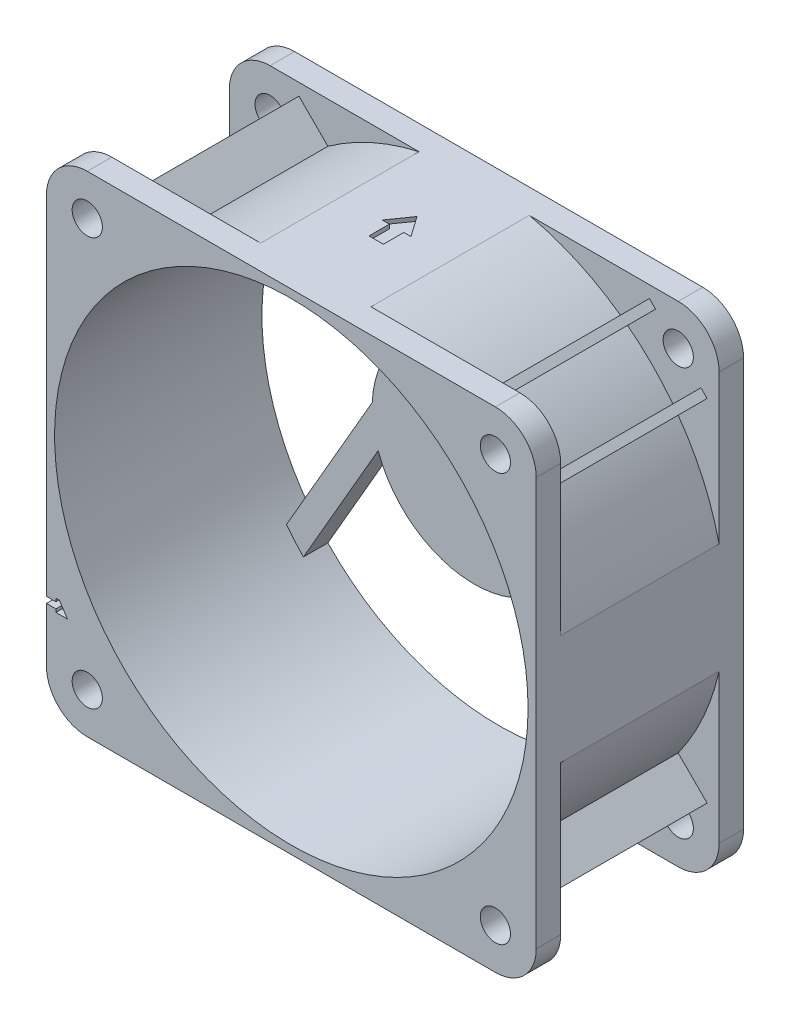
ISO-10303-21;
HEADER;
FILE_DESCRIPTION(('STEP AP214'),'2;1');
FILE_NAME('part.step','',(''),(''),'','','');
FILE_SCHEMA(('AUTOMOTIVE_DESIGN { 1 0 10303 214 1 1 1 1 }'));
ENDSEC;
DATA;
#1=APPLICATION_CONTEXT('core data for automotive mechanical design processes');
#2=APPLICATION_PROTOCOL_DEFINITION('international standard','automotive_design',2000,#1);
#3=PRODUCT_CONTEXT('',#1,'mechanical');
#4=PRODUCT('Part','Part','',(#3));
#5=PRODUCT_RELATED_PRODUCT_CATEGORY('part','',(#4));
#6=PRODUCT_DEFINITION_FORMATION('','',#4);
#7=PRODUCT_DEFINITION_CONTEXT('part definition',#1,'design');
#8=PRODUCT_DEFINITION('design','',#6,#7);
#9=PRODUCT_DEFINITION_SHAPE('','',#8);
#10=(LENGTH_UNIT() NAMED_UNIT(*) SI_UNIT(.MILLI.,.METRE.));
#11=(NAMED_UNIT(*) PLANE_ANGLE_UNIT() SI_UNIT($,.RADIAN.));
#12=(NAMED_UNIT(*) SI_UNIT($,.STERADIAN.) SOLID_ANGLE_UNIT());
#13=UNCERTAINTY_MEASURE_WITH_UNIT(LENGTH_MEASURE(1.E-05),#10,'distance_accuracy_value','');
#14=(GEOMETRIC_REPRESENTATION_CONTEXT(3) GLOBAL_UNCERTAINTY_ASSIGNED_CONTEXT((#13)) GLOBAL_UNIT_ASSIGNED_CONTEXT((#10,
#11,#12)) REPRESENTATION_CONTEXT('',''));
#15=CARTESIAN_POINT('',(0.,0.,0.));
#16=DIRECTION('',(0.,0.,1.));
#17=DIRECTION('',(1.,0.,0.));
#18=AXIS2_PLACEMENT_3D('',#15,#16,#17);
#19=CARTESIAN_POINT('',(25.,30.,110.252813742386));
#20=DIRECTION('',(0.,-1.,0.));
#21=DIRECTION('',(1.,0.,0.));
#22=AXIS2_PLACEMENT_3D('',#19,#20,#21);
#23=PLANE('',#22);
#24=DIRECTION('',(-1.,0.,0.));
#25=VECTOR('',#24,1.);
#26=CARTESIAN_POINT('',(25.,30.,2.99999999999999));
#27=LINE('',#26,#25);
#28=CARTESIAN_POINT('',(25.,30.,2.99999999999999));
#29=VERTEX_POINT('',#28);
#30=CARTESIAN_POINT('',(6.75000000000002,30.,2.99999999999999));
#31=VERTEX_POINT('',#30);
#32=EDGE_CURVE('E1010',#29,#31,#27,.T.);
#33=ORIENTED_EDGE('',*,*,#32,.F.);
#34=DIRECTION('',(0.,0.,-1.));
#35=VECTOR('',#34,1.);
#36=CARTESIAN_POINT('',(25.,30.,110.252813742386));
#37=LINE('',#36,#35);
#38=CARTESIAN_POINT('',(25.,30.,0.));
#39=VERTEX_POINT('',#38);
#40=EDGE_CURVE('E1112',#29,#39,#37,.T.);
#41=ORIENTED_EDGE('',*,*,#40,.T.);
#42=DIRECTION('',(-1.,0.,0.));
#43=VECTOR('',#42,1.);
#44=CARTESIAN_POINT('',(25.,30.,0.));
#45=LINE('',#44,#43);
#46=CARTESIAN_POINT('',(-25.,29.9999999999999,0.));
#47=VERTEX_POINT('',#46);
#48=EDGE_CURVE('E1077',#39,#47,#45,.T.);
#49=ORIENTED_EDGE('',*,*,#48,.T.);
#50=DIRECTION('',(0.,0.,-1.));
#51=VECTOR('',#50,1.);
#52=CARTESIAN_POINT('',(-25.,29.9999999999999,110.252813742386));
#53=LINE('',#52,#51);
#54=CARTESIAN_POINT('',(-25.,30.,2.99999999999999));
#55=VERTEX_POINT('',#54);
#56=EDGE_CURVE('E1108',#55,#47,#53,.T.);
#57=ORIENTED_EDGE('',*,*,#56,.F.);
#58=CARTESIAN_POINT('',(-6.75000000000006,30.,2.99999999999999));
#59=VERTEX_POINT('',#58);
#60=EDGE_CURVE('E1013',#59,#55,#27,.T.);
#61=ORIENTED_EDGE('',*,*,#60,.F.);
#62=DIRECTION('',(0.,0.,1.));
#63=VECTOR('',#62,1.);
#64=CARTESIAN_POINT('',(-6.75000000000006,30.,25.4));
#65=LINE('',#64,#63);
#66=CARTESIAN_POINT('',(-6.75000000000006,30.,22.4));
#67=VERTEX_POINT('',#66);
#68=EDGE_CURVE('E1022',#67,#59,#65,.F.);
#69=ORIENTED_EDGE('',*,*,#68,.F.);
#70=DIRECTION('',(1.,0.,0.));
#71=VECTOR('',#70,1.);
#72=CARTESIAN_POINT('',(25.,30.,22.4));
#73=LINE('',#72,#71);
#74=CARTESIAN_POINT('',(-25.,30.,22.4));
#75=VERTEX_POINT('',#74);
#76=EDGE_CURVE('E992',#75,#67,#73,.T.);
#77=ORIENTED_EDGE('',*,*,#76,.F.);
#78=CARTESIAN_POINT('',(-25.,29.9999999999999,25.4));
#79=VERTEX_POINT('',#78);
#80=EDGE_CURVE('E1109',#79,#75,#53,.T.);
#81=ORIENTED_EDGE('',*,*,#80,.F.);
#82=DIRECTION('',(-1.,0.,0.));
#83=VECTOR('',#82,1.);
#84=CARTESIAN_POINT('',(25.,30.,25.4));
#85=LINE('',#84,#83);
#86=CARTESIAN_POINT('',(25.,30.,25.4));
#87=VERTEX_POINT('',#86);
#88=EDGE_CURVE('E1051',#87,#79,#85,.T.);
#89=ORIENTED_EDGE('',*,*,#88,.F.);
#90=CARTESIAN_POINT('',(25.,30.,22.4));
#91=VERTEX_POINT('',#90);
#92=EDGE_CURVE('E1113',#87,#91,#37,.T.);
#93=ORIENTED_EDGE('',*,*,#92,.T.);
#94=CARTESIAN_POINT('',(6.75000000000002,30.,22.4));
#95=VERTEX_POINT('',#94);
#96=EDGE_CURVE('E990',#95,#91,#73,.T.);
#97=ORIENTED_EDGE('',*,*,#96,.F.);
#98=DIRECTION('',(0.,0.,1.));
#99=VECTOR('',#98,1.);
#100=CARTESIAN_POINT('',(6.75000000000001,30.,25.4));
#101=LINE('',#100,#99);
#102=EDGE_CURVE('E1024',#31,#95,#101,.T.);
#103=ORIENTED_EDGE('',*,*,#102,.F.);
#104=EDGE_LOOP('',(#33,#41,#49,#57,#61,#69,#77,#81,#89,#93,#97,#103));
#105=FACE_BOUND('',#104,.T.);
#106=DIRECTION('',(0.,0.,-1.));
#107=VECTOR('',#106,1.);
#108=CARTESIAN_POINT('',(0.881634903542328,30.,15.));
#109=LINE('',#108,#107);
#110=CARTESIAN_POINT('',(0.881634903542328,30.,15.));
#111=VERTEX_POINT('',#110);
#112=CARTESIAN_POINT('',(0.881634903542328,30.,12.5));
#113=VERTEX_POINT('',#112);
#114=EDGE_CURVE('E549',#111,#113,#109,.T.);
#115=ORIENTED_EDGE('',*,*,#114,.F.);
#116=DIRECTION('',(1.,0.,0.));
#117=VECTOR('',#116,1.);
#118=CARTESIAN_POINT('',(-0.881634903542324,30.,15.));
#119=LINE('',#118,#117);
#120=CARTESIAN_POINT('',(-0.881634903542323,30.,15.));
#121=VERTEX_POINT('',#120);
#122=EDGE_CURVE('E583',#121,#111,#119,.T.);
#123=ORIENTED_EDGE('',*,*,#122,.F.);
#124=DIRECTION('',(0.,0.,1.));
#125=VECTOR('',#124,1.);
#126=CARTESIAN_POINT('',(-0.881634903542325,30.,12.5));
#127=LINE('',#126,#125);
#128=CARTESIAN_POINT('',(-0.881634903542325,30.,12.5));
#129=VERTEX_POINT('',#128);
#130=EDGE_CURVE('E581',#129,#121,#127,.T.);
#131=ORIENTED_EDGE('',*,*,#130,.F.);
#132=DIRECTION('',(1.,0.,0.));
#133=VECTOR('',#132,1.);
#134=CARTESIAN_POINT('',(-1.75051884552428,30.,12.5));
#135=LINE('',#134,#133);
#136=CARTESIAN_POINT('',(-1.75051884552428,30.,12.5));
#137=VERTEX_POINT('',#136);
#138=EDGE_CURVE('E579',#137,#129,#135,.T.);
#139=ORIENTED_EDGE('',*,*,#138,.F.);
#140=DIRECTION('',(-0.573576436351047,0.,0.819152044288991));
#141=VECTOR('',#140,1.);
#142=CARTESIAN_POINT('',(0.,30.,10.));
#143=LINE('',#142,#141);
#144=CARTESIAN_POINT('',(0.,30.,10.));
#145=VERTEX_POINT('',#144);
#146=EDGE_CURVE('E575',#145,#137,#143,.T.);
#147=ORIENTED_EDGE('',*,*,#146,.F.);
#148=DIRECTION('',(-0.573576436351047,0.,-0.819152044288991));
#149=VECTOR('',#148,1.);
#150=CARTESIAN_POINT('',(1.75051884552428,30.,12.5));
#151=LINE('',#150,#149);
#152=CARTESIAN_POINT('',(1.75051884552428,30.,12.5));
#153=VERTEX_POINT('',#152);
#154=EDGE_CURVE('E573',#153,#145,#151,.T.);
#155=ORIENTED_EDGE('',*,*,#154,.F.);
#156=DIRECTION('',(1.,0.,0.));
#157=VECTOR('',#156,1.);
#158=CARTESIAN_POINT('',(0.881634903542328,30.,12.5));
#159=LINE('',#158,#157);
#160=EDGE_CURVE('E560',#113,#153,#159,.T.);
#161=ORIENTED_EDGE('',*,*,#160,.F.);
#162=EDGE_LOOP('',(#115,#123,#131,#139,#147,#155,#161));
#163=FACE_BOUND('',#162,.T.);
#164=ADVANCED_FACE('F33',(#105,#163),#23,.F.);
#165=CARTESIAN_POINT('',(-30.,25.,110.252813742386));
#166=DIRECTION('',(1.,0.,0.));
#167=DIRECTION('',(0.,1.,0.));
#168=AXIS2_PLACEMENT_3D('',#165,#166,#167);
#169=PLANE('',#168);
#170=DIRECTION('',(0.,-1.,0.));
#171=VECTOR('',#170,1.);
#172=CARTESIAN_POINT('',(-30.,25.,25.4));
#173=LINE('',#172,#171);
#174=CARTESIAN_POINT('',(-30.,-18.3483350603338,25.4));
#175=VERTEX_POINT('',#174);
#176=CARTESIAN_POINT('',(-30.,-25.,25.4));
#177=VERTEX_POINT('',#176);
#178=EDGE_CURVE('E1044',#175,#177,#173,.T.);
#179=ORIENTED_EDGE('',*,*,#178,.F.);
#180=DIRECTION('',(0.,0.,-1.));
#181=VECTOR('',#180,1.);
#182=CARTESIAN_POINT('',(-30.,-18.3483350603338,110.252813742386));
#183=LINE('',#182,#181);
#184=CARTESIAN_POINT('',(-30.,-18.3483350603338,22.4));
#185=VERTEX_POINT('',#184);
#186=EDGE_CURVE('E1179',#175,#185,#183,.T.);
#187=ORIENTED_EDGE('',*,*,#186,.T.);
#188=DIRECTION('',(0.,1.,0.));
#189=VECTOR('',#188,1.);
#190=CARTESIAN_POINT('',(-30.,25.,22.4));
#191=LINE('',#190,#189);
#192=CARTESIAN_POINT('',(-30.,-25.,22.4));
#193=VERTEX_POINT('',#192);
#194=EDGE_CURVE('E998',#193,#185,#191,.T.);
#195=ORIENTED_EDGE('',*,*,#194,.F.);
#196=DIRECTION('',(0.,0.,-1.));
#197=VECTOR('',#196,1.);
#198=CARTESIAN_POINT('',(-30.,-25.,110.252813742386));
#199=LINE('',#198,#197);
#200=EDGE_CURVE('E1101',#177,#193,#199,.T.);
#201=ORIENTED_EDGE('',*,*,#200,.F.);
#202=EDGE_LOOP('',(#179,#187,#195,#201));
#203=FACE_BOUND('',#202,.T.);
#204=ADVANCED_FACE('F1210',(#203),#169,.F.);
#205=CARTESIAN_POINT('',(0.,0.,110.252813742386));
#206=DIRECTION('',(0.,0.,-1.));
#207=DIRECTION('',(-1.,0.,0.));
#208=AXIS2_PLACEMENT_3D('',#205,#206,#207);
#209=CYLINDRICAL_SURFACE('',#208,29.);
#210=CARTESIAN_POINT('',(0.,0.,25.4));
#211=DIRECTION('',(0.,0.,1.));
#212=DIRECTION('',(1.,0.,0.));
#213=AXIS2_PLACEMENT_3D('',#210,#211,#212);
#214=CIRCLE('',#213,29.);
#215=CARTESIAN_POINT('',(29.,0.,25.4));
#216=VERTEX_POINT('',#215);
#217=EDGE_CURVE('E1037',#216,#216,#214,.T.);
#218=ORIENTED_EDGE('',*,*,#217,.T.);
#219=EDGE_LOOP('',(#218));
#220=FACE_BOUND('',#219,.T.);
#221=CARTESIAN_POINT('',(0.,0.,3.));
#222=DIRECTION('',(0.,0.,1.));
#223=DIRECTION('',(-0.499999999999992,0.866025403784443,0.));
#224=AXIS2_PLACEMENT_3D('',#221,#222,#223);
#225=CIRCLE('',#224,29.);
#226=CARTESIAN_POINT('',(26.8017176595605,-11.0755555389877,3.));
#227=VERTEX_POINT('',#226);
#228=CARTESIAN_POINT('',(27.8529244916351,-8.07555553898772,3.));
#229=VERTEX_POINT('',#228);
#230=EDGE_CURVE('E654',#227,#229,#225,.T.);
#231=ORIENTED_EDGE('',*,*,#230,.F.);
#232=DIRECTION('',(0.,0.,-1.));
#233=VECTOR('',#232,1.);
#234=CARTESIAN_POINT('',(26.8017176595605,-11.0755555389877,3.));
#235=LINE('',#234,#233);
#236=CARTESIAN_POINT('',(26.8017176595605,-11.0755555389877,0.));
#237=VERTEX_POINT('',#236);
#238=EDGE_CURVE('E668',#227,#237,#235,.T.);
#239=ORIENTED_EDGE('',*,*,#238,.T.);
#240=CARTESIAN_POINT('',(0.,0.,0.));
#241=DIRECTION('',(0.,0.,1.));
#242=DIRECTION('',(1.,0.,0.));
#243=AXIS2_PLACEMENT_3D('',#240,#241,#242);
#244=CIRCLE('',#243,29.);
#245=CARTESIAN_POINT('',(-20.9200984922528,-20.0835624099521,0.));
#246=VERTEX_POINT('',#245);
#247=EDGE_CURVE('E1064',#246,#237,#244,.T.);
#248=ORIENTED_EDGE('',*,*,#247,.F.);
#249=DIRECTION('',(0.,0.,-1.));
#250=VECTOR('',#249,1.);
#251=CARTESIAN_POINT('',(-20.9200984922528,-20.0835624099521,3.));
#252=LINE('',#251,#250);
#253=CARTESIAN_POINT('',(-20.9200984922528,-20.0835624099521,3.));
#254=VERTEX_POINT('',#253);
#255=EDGE_CURVE('E713',#254,#246,#252,.T.);
#256=ORIENTED_EDGE('',*,*,#255,.F.);
#257=CARTESIAN_POINT('',(0.,0.,3.));
#258=DIRECTION('',(0.,0.,1.));
#259=DIRECTION('',(1.,0.,0.));
#260=AXIS2_PLACEMENT_3D('',#257,#258,#259);
#261=CIRCLE('',#260,29.);
#262=CARTESIAN_POINT('',(-22.9925712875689,-17.6731905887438,3.));
#263=VERTEX_POINT('',#262);
#264=EDGE_CURVE('E701',#263,#254,#261,.T.);
#265=ORIENTED_EDGE('',*,*,#264,.F.);
#266=DIRECTION('',(0.,0.,-1.));
#267=VECTOR('',#266,1.);
#268=CARTESIAN_POINT('',(-22.9925712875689,-17.6731905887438,3.));
#269=LINE('',#268,#267);
#270=CARTESIAN_POINT('',(-22.9925712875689,-17.6731905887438,0.));
#271=VERTEX_POINT('',#270);
#272=EDGE_CURVE('E716',#263,#271,#269,.T.);
#273=ORIENTED_EDGE('',*,*,#272,.T.);
#274=CARTESIAN_POINT('',(-6.93282599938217,28.1591179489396,0.));
#275=VERTEX_POINT('',#274);
#276=EDGE_CURVE('E1063',#275,#271,#244,.T.);
#277=ORIENTED_EDGE('',*,*,#276,.F.);
#278=DIRECTION('',(0.,0.,-1.));
#279=VECTOR('',#278,1.);
#280=CARTESIAN_POINT('',(-6.93282599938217,28.1591179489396,3.));
#281=LINE('',#280,#279);
#282=CARTESIAN_POINT('',(-6.93282599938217,28.1591179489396,3.));
#283=VERTEX_POINT('',#282);
#284=EDGE_CURVE('E689',#283,#275,#281,.T.);
#285=ORIENTED_EDGE('',*,*,#284,.F.);
#286=CARTESIAN_POINT('',(0.,0.,3.));
#287=DIRECTION('',(0.,0.,1.));
#288=DIRECTION('',(-0.500000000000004,-0.866025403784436,0.));
#289=AXIS2_PLACEMENT_3D('',#286,#287,#288);
#290=CIRCLE('',#289,29.);
#291=CARTESIAN_POINT('',(-3.80914637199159,28.7487461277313,3.));
#292=VERTEX_POINT('',#291);
#293=EDGE_CURVE('E677',#292,#283,#290,.T.);
#294=ORIENTED_EDGE('',*,*,#293,.F.);
#295=DIRECTION('',(0.,0.,-1.));
#296=VECTOR('',#295,1.);
#297=CARTESIAN_POINT('',(-3.80914637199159,28.7487461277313,3.));
#298=LINE('',#297,#296);
#299=CARTESIAN_POINT('',(-3.80914637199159,28.7487461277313,0.));
#300=VERTEX_POINT('',#299);
#301=EDGE_CURVE('E692',#292,#300,#298,.T.);
#302=ORIENTED_EDGE('',*,*,#301,.T.);
#303=CARTESIAN_POINT('',(27.8529244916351,-8.07555553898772,0.));
#304=VERTEX_POINT('',#303);
#305=EDGE_CURVE('E1068',#304,#300,#244,.T.);
#306=ORIENTED_EDGE('',*,*,#305,.F.);
#307=DIRECTION('',(0.,0.,-1.));
#308=VECTOR('',#307,1.);
#309=CARTESIAN_POINT('',(27.8529244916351,-8.07555553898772,3.));
#310=LINE('',#309,#308);
#311=EDGE_CURVE('E665',#229,#304,#310,.T.);
#312=ORIENTED_EDGE('',*,*,#311,.F.);
#313=EDGE_LOOP('',(#231,#239,#248,#256,#265,#273,#277,#285,#294,#302,#306,#312));
#314=FACE_BOUND('',#313,.T.);
#315=ADVANCED_FACE('F1414',(#220,#314),#209,.F.);
#316=CARTESIAN_POINT('',(25.,-24.9999999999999,0.));
#317=DIRECTION('',(0.,0.,1.));
#318=DIRECTION('',(1.,0.,0.));
#319=AXIS2_PLACEMENT_3D('',#316,#317,#318);
#320=PLANE('',#319);
#321=DIRECTION('',(-0.500000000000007,-0.866025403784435,0.));
#322=VECTOR('',#321,1.);
#323=CARTESIAN_POINT('',(-12.4892143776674,0.519157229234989,0.));
#324=LINE('',#323,#322);
#325=CARTESIAN_POINT('',(-12.4892143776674,0.519157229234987,0.));
#326=VERTEX_POINT('',#325);
#327=EDGE_CURVE('E698',#326,#271,#324,.T.);
#328=ORIENTED_EDGE('',*,*,#327,.F.);
#329=CARTESIAN_POINT('',(0.,0.,0.));
#330=DIRECTION('',(0.,0.,1.));
#331=DIRECTION('',(1.,0.,0.));
#332=AXIS2_PLACEMENT_3D('',#329,#330,#331);
#333=CIRCLE('',#332,12.5);
#334=CARTESIAN_POINT('',(2.22301252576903,12.3007404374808,0.));
#335=VERTEX_POINT('',#334);
#336=EDGE_CURVE('E612',#335,#326,#333,.T.);
#337=ORIENTED_EDGE('',*,*,#336,.F.);
#338=DIRECTION('',(0.499999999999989,-0.866025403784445,0.));
#339=VECTOR('',#338,1.);
#340=CARTESIAN_POINT('',(2.22301252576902,12.3007404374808,0.));
#341=LINE('',#340,#339);
#342=EDGE_CURVE('E678',#275,#335,#341,.T.);
#343=ORIENTED_EDGE('',*,*,#342,.F.);
#344=ORIENTED_EDGE('',*,*,#276,.T.);
#345=EDGE_LOOP('',(#328,#337,#343,#344));
#346=FACE_BOUND('',#345,.T.);
#347=DIRECTION('',(-0.499999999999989,0.866025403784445,0.));
#348=VECTOR('',#347,1.);
#349=CARTESIAN_POINT('',(6.69421053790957,10.5563983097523,0.));
#350=LINE('',#349,#348);
#351=CARTESIAN_POINT('',(6.69421053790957,10.5563983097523,0.));
#352=VERTEX_POINT('',#351);
#353=EDGE_CURVE('E674',#352,#300,#350,.T.);
#354=ORIENTED_EDGE('',*,*,#353,.F.);
#355=CARTESIAN_POINT('',(9.54124744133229,-8.0755555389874,0.));
#356=VERTEX_POINT('',#355);
#357=EDGE_CURVE('E568',#356,#352,#333,.T.);
#358=ORIENTED_EDGE('',*,*,#357,.F.);
#359=DIRECTION('',(-1.,0.,0.));
#360=VECTOR('',#359,1.);
#361=CARTESIAN_POINT('',(9.54124744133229,-8.0755555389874,0.));
#362=LINE('',#361,#360);
#363=EDGE_CURVE('E655',#304,#356,#362,.T.);
#364=ORIENTED_EDGE('',*,*,#363,.F.);
#365=ORIENTED_EDGE('',*,*,#305,.T.);
#366=EDGE_LOOP('',(#354,#358,#364,#365));
#367=FACE_BOUND('',#366,.T.);
#368=CARTESIAN_POINT('',(-25.0000000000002,-24.9999999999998,0.));
#369=DIRECTION('',(0.,0.,1.));
#370=DIRECTION('',(-1.,0.,0.));
#371=AXIS2_PLACEMENT_3D('',#368,#369,#370);
#372=CIRCLE('',#371,1.85);
#373=CARTESIAN_POINT('',(-26.8500000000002,-24.9999999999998,0.));
#374=VERTEX_POINT('',#373);
#375=EDGE_CURVE('E732',#374,#374,#372,.T.);
#376=ORIENTED_EDGE('',*,*,#375,.T.);
#377=EDGE_LOOP('',(#376));
#378=FACE_BOUND('',#377,.T.);
#379=CARTESIAN_POINT('',(25.,25.,0.));
#380=DIRECTION('',(0.,0.,1.));
#381=DIRECTION('',(1.,0.,0.));
#382=AXIS2_PLACEMENT_3D('',#379,#380,#381);
#383=CIRCLE('',#382,1.85);
#384=CARTESIAN_POINT('',(26.85,25.,0.));
#385=VERTEX_POINT('',#384);
#386=EDGE_CURVE('E752',#385,#385,#383,.T.);
#387=ORIENTED_EDGE('',*,*,#386,.T.);
#388=EDGE_LOOP('',(#387));
#389=FACE_BOUND('',#388,.T.);
#390=CARTESIAN_POINT('',(25.,-24.9999999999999,0.));
#391=DIRECTION('',(0.,0.,1.));
#392=DIRECTION('',(1.,0.,0.));
#393=AXIS2_PLACEMENT_3D('',#390,#391,#392);
#394=CIRCLE('',#393,5.00000000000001);
#395=CARTESIAN_POINT('',(25.,-30.,0.));
#396=VERTEX_POINT('',#395);
#397=CARTESIAN_POINT('',(30.,-25.,0.));
#398=VERTEX_POINT('',#397);
#399=EDGE_CURVE('E1067',#396,#398,#394,.T.);
#400=ORIENTED_EDGE('',*,*,#399,.F.);
#401=DIRECTION('',(1.,0.,0.));
#402=VECTOR('',#401,1.);
#403=CARTESIAN_POINT('',(-25.,-30.,0.));
#404=LINE('',#403,#402);
#405=CARTESIAN_POINT('',(-25.,-30.,0.));
#406=VERTEX_POINT('',#405);
#407=EDGE_CURVE('E1089',#406,#396,#404,.T.);
#408=ORIENTED_EDGE('',*,*,#407,.F.);
#409=CARTESIAN_POINT('',(-25.,-25.,0.));
#410=DIRECTION('',(0.,0.,1.));
#411=DIRECTION('',(1.,0.,0.));
#412=AXIS2_PLACEMENT_3D('',#409,#410,#411);
#413=CIRCLE('',#412,4.99999999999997);
#414=CARTESIAN_POINT('',(-30.,-25.,0.));
#415=VERTEX_POINT('',#414);
#416=EDGE_CURVE('E1086',#415,#406,#413,.T.);
#417=ORIENTED_EDGE('',*,*,#416,.F.);
#418=DIRECTION('',(0.,-1.,0.));
#419=VECTOR('',#418,1.);
#420=CARTESIAN_POINT('',(-30.,25.,0.));
#421=LINE('',#420,#419);
#422=CARTESIAN_POINT('',(-30.,25.,0.));
#423=VERTEX_POINT('',#422);
#424=EDGE_CURVE('E1083',#423,#415,#421,.T.);
#425=ORIENTED_EDGE('',*,*,#424,.F.);
#426=CARTESIAN_POINT('',(-25.0000000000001,25.,0.));
#427=DIRECTION('',(0.,0.,1.));
#428=DIRECTION('',(1.,0.,0.));
#429=AXIS2_PLACEMENT_3D('',#426,#427,#428);
#430=CIRCLE('',#429,4.99999999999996);
#431=EDGE_CURVE('E1080',#47,#423,#430,.T.);
#432=ORIENTED_EDGE('',*,*,#431,.F.);
#433=ORIENTED_EDGE('',*,*,#48,.F.);
#434=CARTESIAN_POINT('',(25.,25.,0.));
#435=DIRECTION('',(0.,0.,1.));
#436=DIRECTION('',(1.,0.,0.));
#437=AXIS2_PLACEMENT_3D('',#434,#435,#436);
#438=CIRCLE('',#437,5.00000000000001);
#439=CARTESIAN_POINT('',(30.,25.,0.));
#440=VERTEX_POINT('',#439);
#441=EDGE_CURVE('E1074',#440,#39,#438,.T.);
#442=ORIENTED_EDGE('',*,*,#441,.F.);
#443=DIRECTION('',(0.,1.,0.));
#444=VECTOR('',#443,1.);
#445=CARTESIAN_POINT('',(30.,-25.,0.));
#446=LINE('',#445,#444);
#447=EDGE_CURVE('E1071',#398,#440,#446,.T.);
#448=ORIENTED_EDGE('',*,*,#447,.F.);
#449=EDGE_LOOP('',(#400,#408,#417,#425,#432,#433,#442,#448));
#450=FACE_BOUND('',#449,.T.);
#451=ORIENTED_EDGE('',*,*,#247,.T.);
#452=DIRECTION('',(1.,0.,0.));
#453=VECTOR('',#452,1.);
#454=CARTESIAN_POINT('',(5.79500383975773,-11.0755555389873,0.));
#455=LINE('',#454,#453);
#456=CARTESIAN_POINT('',(5.79500383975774,-11.0755555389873,0.));
#457=VERTEX_POINT('',#456);
#458=EDGE_CURVE('E651',#457,#237,#455,.T.);
#459=ORIENTED_EDGE('',*,*,#458,.F.);
#460=CARTESIAN_POINT('',(-11.7642599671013,-4.22518489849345,0.));
#461=VERTEX_POINT('',#460);
#462=EDGE_CURVE('E615',#461,#457,#333,.T.);
#463=ORIENTED_EDGE('',*,*,#462,.F.);
#464=DIRECTION('',(0.500000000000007,0.866025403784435,0.));
#465=VECTOR('',#464,1.);
#466=CARTESIAN_POINT('',(-11.7642599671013,-4.22518489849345,0.));
#467=LINE('',#466,#465);
#468=EDGE_CURVE('E702',#246,#461,#467,.T.);
#469=ORIENTED_EDGE('',*,*,#468,.F.);
#470=EDGE_LOOP('',(#451,#459,#463,#469));
#471=FACE_BOUND('',#470,.T.);
#472=CARTESIAN_POINT('',(24.9999999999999,-25.0000000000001,0.));
#473=DIRECTION('',(0.,0.,1.));
#474=DIRECTION('',(0.,-1.,0.));
#475=AXIS2_PLACEMENT_3D('',#472,#473,#474);
#476=CIRCLE('',#475,1.85);
#477=CARTESIAN_POINT('',(24.9999999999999,-26.8500000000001,0.));
#478=VERTEX_POINT('',#477);
#479=EDGE_CURVE('E742',#478,#478,#476,.T.);
#480=ORIENTED_EDGE('',*,*,#479,.T.);
#481=EDGE_LOOP('',(#480));
#482=FACE_BOUND('',#481,.T.);
#483=CARTESIAN_POINT('',(-24.9999999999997,25.0000000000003,0.));
#484=DIRECTION('',(0.,0.,1.));
#485=DIRECTION('',(0.,1.,0.));
#486=AXIS2_PLACEMENT_3D('',#483,#484,#485);
#487=CIRCLE('',#486,1.85);
#488=CARTESIAN_POINT('',(-24.9999999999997,26.8500000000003,0.));
#489=VERTEX_POINT('',#488);
#490=EDGE_CURVE('E722',#489,#489,#487,.T.);
#491=ORIENTED_EDGE('',*,*,#490,.T.);
#492=EDGE_LOOP('',(#491));
#493=FACE_BOUND('',#492,.T.);
#494=ADVANCED_FACE('F1321',(#346,#367,#378,#389,#450,#471,#482,#493),#320,.F.);
#495=CARTESIAN_POINT('',(0.,0.,25.4));
#496=DIRECTION('',(0.,0.,1.));
#497=DIRECTION('',(1.,0.,0.));
#498=AXIS2_PLACEMENT_3D('',#495,#496,#497);
#499=PLANE('',#498);
#500=DIRECTION('',(1.,0.,0.));
#501=VECTOR('',#500,1.);
#502=CARTESIAN_POINT('',(-28.8418575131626,-18.3483350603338,25.4));
#503=LINE('',#502,#501);
#504=CARTESIAN_POINT('',(-28.8418575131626,-18.3483350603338,25.4));
#505=VERTEX_POINT('',#504);
#506=EDGE_CURVE('E626',#175,#505,#503,.T.);
#507=ORIENTED_EDGE('',*,*,#506,.F.);
#508=ORIENTED_EDGE('',*,*,#178,.T.);
#509=CARTESIAN_POINT('',(-25.,-25.,25.4));
#510=DIRECTION('',(0.,0.,1.));
#511=DIRECTION('',(1.,0.,0.));
#512=AXIS2_PLACEMENT_3D('',#509,#510,#511);
#513=CIRCLE('',#512,4.99999999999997);
#514=CARTESIAN_POINT('',(-25.,-30.,25.4));
#515=VERTEX_POINT('',#514);
#516=EDGE_CURVE('E1041',#177,#515,#513,.T.);
#517=ORIENTED_EDGE('',*,*,#516,.T.);
#518=DIRECTION('',(1.,0.,0.));
#519=VECTOR('',#518,1.);
#520=CARTESIAN_POINT('',(-25.,-30.,25.4));
#521=LINE('',#520,#519);
#522=CARTESIAN_POINT('',(25.,-30.,25.4));
#523=VERTEX_POINT('',#522);
#524=EDGE_CURVE('E1038',#515,#523,#521,.T.);
#525=ORIENTED_EDGE('',*,*,#524,.T.);
#526=CARTESIAN_POINT('',(25.,-24.9999999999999,25.4));
#527=DIRECTION('',(0.,0.,1.));
#528=DIRECTION('',(1.,0.,0.));
#529=AXIS2_PLACEMENT_3D('',#526,#527,#528);
#530=CIRCLE('',#529,5.00000000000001);
#531=CARTESIAN_POINT('',(30.,-25.,25.4));
#532=VERTEX_POINT('',#531);
#533=EDGE_CURVE('E1060',#523,#532,#530,.T.);
#534=ORIENTED_EDGE('',*,*,#533,.T.);
#535=DIRECTION('',(0.,1.,0.));
#536=VECTOR('',#535,1.);
#537=CARTESIAN_POINT('',(30.,-25.,25.4));
#538=LINE('',#537,#536);
#539=CARTESIAN_POINT('',(30.,25.,25.4));
#540=VERTEX_POINT('',#539);
#541=EDGE_CURVE('E1057',#532,#540,#538,.T.);
#542=ORIENTED_EDGE('',*,*,#541,.T.);
#543=CARTESIAN_POINT('',(25.,25.,25.4));
#544=DIRECTION('',(0.,0.,1.));
#545=DIRECTION('',(1.,0.,0.));
#546=AXIS2_PLACEMENT_3D('',#543,#544,#545);
#547=CIRCLE('',#546,5.00000000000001);
#548=EDGE_CURVE('E1054',#540,#87,#547,.T.);
#549=ORIENTED_EDGE('',*,*,#548,.T.);
#550=ORIENTED_EDGE('',*,*,#88,.T.);
#551=CARTESIAN_POINT('',(-25.0000000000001,25.,25.4));
#552=DIRECTION('',(0.,0.,1.));
#553=DIRECTION('',(1.,0.,0.));
#554=AXIS2_PLACEMENT_3D('',#551,#552,#553);
#555=CIRCLE('',#554,4.99999999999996);
#556=CARTESIAN_POINT('',(-30.,25.,25.4));
#557=VERTEX_POINT('',#556);
#558=EDGE_CURVE('E1048',#79,#557,#555,.T.);
#559=ORIENTED_EDGE('',*,*,#558,.T.);
#560=CARTESIAN_POINT('',(-30.,-17.5957284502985,25.4));
#561=VERTEX_POINT('',#560);
#562=EDGE_CURVE('E1045',#557,#561,#173,.T.);
#563=ORIENTED_EDGE('',*,*,#562,.T.);
#564=DIRECTION('',(-1.,0.,0.));
#565=VECTOR('',#564,1.);
#566=CARTESIAN_POINT('',(-28.8418575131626,-17.5957284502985,25.4));
#567=LINE('',#566,#565);
#568=CARTESIAN_POINT('',(-28.8418575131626,-17.5957284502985,25.4));
#569=VERTEX_POINT('',#568);
#570=EDGE_CURVE('E56',#569,#561,#567,.T.);
#571=ORIENTED_EDGE('',*,*,#570,.F.);
#572=DIRECTION('',(0.,-1.,0.));
#573=VECTOR('',#572,1.);
#574=CARTESIAN_POINT('',(-28.8418575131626,-17.2194251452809,25.4));
#575=LINE('',#574,#573);
#576=CARTESIAN_POINT('',(-28.8418575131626,-17.2194251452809,25.4));
#577=VERTEX_POINT('',#576);
#578=EDGE_CURVE('E622',#577,#569,#575,.T.);
#579=ORIENTED_EDGE('',*,*,#578,.F.);
#580=DIRECTION('',(-1.,0.,0.));
#581=VECTOR('',#580,1.);
#582=CARTESIAN_POINT('',(-28.8418575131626,-17.2194251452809,25.4));
#583=LINE('',#582,#581);
#584=CARTESIAN_POINT('',(-28.3996632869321,-17.2194251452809,25.4));
#585=VERTEX_POINT('',#584);
#586=EDGE_CURVE('E619',#585,#577,#583,.T.);
#587=ORIENTED_EDGE('',*,*,#586,.F.);
#588=CARTESIAN_POINT('',(0.,0.,25.4));
#589=DIRECTION('',(0.,0.,-1.));
#590=DIRECTION('',(1.,0.,0.));
#591=AXIS2_PLACEMENT_3D('',#588,#589,#590);
#592=CIRCLE('',#591,33.2121886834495);
#593=CARTESIAN_POINT('',(-27.4305923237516,-18.7246383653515,25.4));
#594=VERTEX_POINT('',#593);
#595=EDGE_CURVE('E616',#594,#585,#592,.T.);
#596=ORIENTED_EDGE('',*,*,#595,.F.);
#597=DIRECTION('',(1.,0.,0.));
#598=VECTOR('',#597,1.);
#599=CARTESIAN_POINT('',(-27.4305923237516,-18.7246383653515,25.4));
#600=LINE('',#599,#598);
#601=CARTESIAN_POINT('',(-28.8418575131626,-18.7246383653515,25.4));
#602=VERTEX_POINT('',#601);
#603=EDGE_CURVE('E632',#602,#594,#600,.T.);
#604=ORIENTED_EDGE('',*,*,#603,.F.);
#605=DIRECTION('',(0.,-1.,0.));
#606=VECTOR('',#605,1.);
#607=CARTESIAN_POINT('',(-28.8418575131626,-18.3483350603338,25.4));
#608=LINE('',#607,#606);
#609=EDGE_CURVE('E629',#505,#602,#608,.T.);
#610=ORIENTED_EDGE('',*,*,#609,.F.);
#611=EDGE_LOOP('',(#507,#508,#517,#525,#534,#542,#549,#550,#559,#563,#571,#579,#587,#596,#604,#610));
#612=FACE_BOUND('',#611,.T.);
#613=CARTESIAN_POINT('',(-25.0000000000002,-24.9999999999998,25.4));
#614=DIRECTION('',(0.,0.,1.));
#615=DIRECTION('',(-1.,0.,0.));
#616=AXIS2_PLACEMENT_3D('',#613,#614,#615);
#617=CIRCLE('',#616,1.85);
#618=CARTESIAN_POINT('',(-26.8500000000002,-24.9999999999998,25.4));
#619=VERTEX_POINT('',#618);
#620=EDGE_CURVE('E733',#619,#619,#617,.T.);
#621=ORIENTED_EDGE('',*,*,#620,.F.);
#622=EDGE_LOOP('',(#621));
#623=FACE_BOUND('',#622,.T.);
#624=CARTESIAN_POINT('',(25.,25.,25.4));
#625=DIRECTION('',(0.,0.,1.));
#626=DIRECTION('',(1.,0.,0.));
#627=AXIS2_PLACEMENT_3D('',#624,#625,#626);
#628=CIRCLE('',#627,1.85);
#629=CARTESIAN_POINT('',(26.85,25.,25.4));
#630=VERTEX_POINT('',#629);
#631=EDGE_CURVE('E753',#630,#630,#628,.T.);
#632=ORIENTED_EDGE('',*,*,#631,.F.);
#633=EDGE_LOOP('',(#632));
#634=FACE_BOUND('',#633,.T.);
#635=ORIENTED_EDGE('',*,*,#217,.F.);
#636=EDGE_LOOP('',(#635));
#637=FACE_BOUND('',#636,.T.);
#638=CARTESIAN_POINT('',(24.9999999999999,-25.0000000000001,25.4));
#639=DIRECTION('',(0.,0.,1.));
#640=DIRECTION('',(0.,-1.,0.));
#641=AXIS2_PLACEMENT_3D('',#638,#639,#640);
#642=CIRCLE('',#641,1.85);
#643=CARTESIAN_POINT('',(24.9999999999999,-26.8500000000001,25.4));
#644=VERTEX_POINT('',#643);
#645=EDGE_CURVE('E743',#644,#644,#642,.T.);
#646=ORIENTED_EDGE('',*,*,#645,.F.);
#647=EDGE_LOOP('',(#646));
#648=FACE_BOUND('',#647,.T.);
#649=CARTESIAN_POINT('',(-24.9999999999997,25.0000000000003,25.4));
#650=DIRECTION('',(0.,0.,1.));
#651=DIRECTION('',(0.,1.,0.));
#652=AXIS2_PLACEMENT_3D('',#649,#650,#651);
#653=CIRCLE('',#652,1.85);
#654=CARTESIAN_POINT('',(-24.9999999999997,26.8500000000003,25.4));
#655=VERTEX_POINT('',#654);
#656=EDGE_CURVE('E723',#655,#655,#653,.T.);
#657=ORIENTED_EDGE('',*,*,#656,.F.);
#658=EDGE_LOOP('',(#657));
#659=FACE_BOUND('',#658,.T.);
#660=ADVANCED_FACE('F1214',(#612,#623,#634,#637,#648,#659),#499,.T.);
#661=CARTESIAN_POINT('',(0.,30.75,22.4));
#662=DIRECTION('',(0.,0.,-1.));
#663=DIRECTION('',(0.,1.,0.));
#664=AXIS2_PLACEMENT_3D('',#661,#662,#663);
#665=PLANE('',#664);
#666=DIRECTION('',(-0.707106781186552,-0.707106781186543,0.));
#667=VECTOR('',#666,1.);
#668=CARTESIAN_POINT('',(-9.62499999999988,40.375,22.4));
#669=LINE('',#668,#667);
#670=CARTESIAN_POINT('',(-27.7796096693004,22.2203903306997,22.4));
#671=VERTEX_POINT('',#670);
#672=CARTESIAN_POINT('',(-28.5355339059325,21.4644660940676,22.4));
#673=VERTEX_POINT('',#672);
#674=EDGE_CURVE('E791',#671,#673,#669,.T.);
#675=ORIENTED_EDGE('',*,*,#674,.T.);
#676=DIRECTION('',(0.70710678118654,-0.707106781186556,0.));
#677=VECTOR('',#676,1.);
#678=CARTESIAN_POINT('',(-18.9105339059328,11.8394660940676,22.4));
#679=LINE('',#678,#677);
#680=CARTESIAN_POINT('',(-24.9897001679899,17.9186323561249,22.4));
#681=VERTEX_POINT('',#680);
#682=EDGE_CURVE('E785',#673,#681,#679,.T.);
#683=ORIENTED_EDGE('',*,*,#682,.T.);
#684=CARTESIAN_POINT('',(0.,0.,22.4));
#685=DIRECTION('',(0.,0.,1.));
#686=DIRECTION('',(0.,-1.,0.));
#687=AXIS2_PLACEMENT_3D('',#684,#685,#686);
#688=CIRCLE('',#687,30.75);
#689=CARTESIAN_POINT('',(-30.,6.74999999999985,22.4));
#690=VERTEX_POINT('',#689);
#691=EDGE_CURVE('E981',#681,#690,#688,.T.);
#692=ORIENTED_EDGE('',*,*,#691,.T.);
#693=CARTESIAN_POINT('',(-30.,25.,22.4));
#694=VERTEX_POINT('',#693);
#695=EDGE_CURVE('E995',#690,#694,#191,.T.);
#696=ORIENTED_EDGE('',*,*,#695,.T.);
#697=CARTESIAN_POINT('',(-25.0000000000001,25.,22.4));
#698=DIRECTION('',(0.,0.,-1.));
#699=DIRECTION('',(0.,1.,0.));
#700=AXIS2_PLACEMENT_3D('',#697,#698,#699);
#701=CIRCLE('',#700,4.99999999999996);
#702=EDGE_CURVE('E993',#694,#75,#701,.T.);
#703=ORIENTED_EDGE('',*,*,#702,.T.);
#704=ORIENTED_EDGE('',*,*,#76,.T.);
#705=CARTESIAN_POINT('',(-17.9186323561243,24.9897001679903,22.4));
#706=VERTEX_POINT('',#705);
#707=EDGE_CURVE('E1342',#67,#706,#688,.T.);
#708=ORIENTED_EDGE('',*,*,#707,.T.);
#709=DIRECTION('',(-0.707106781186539,0.707106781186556,0.));
#710=VECTOR('',#709,1.);
#711=CARTESIAN_POINT('',(-11.8394660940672,18.910533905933,22.4));
#712=LINE('',#711,#710);
#713=CARTESIAN_POINT('',(-21.4644660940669,28.535533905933,22.4));
#714=VERTEX_POINT('',#713);
#715=EDGE_CURVE('E803',#706,#714,#712,.T.);
#716=ORIENTED_EDGE('',*,*,#715,.T.);
#717=DIRECTION('',(-0.70710678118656,-0.707106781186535,0.));
#718=VECTOR('',#717,1.);
#719=CARTESIAN_POINT('',(-9.6249999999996,40.3749999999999,22.4));
#720=LINE('',#719,#718);
#721=CARTESIAN_POINT('',(-22.2203903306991,27.7796096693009,22.4));
#722=VERTEX_POINT('',#721);
#723=EDGE_CURVE('E812',#714,#722,#720,.T.);
#724=ORIENTED_EDGE('',*,*,#723,.T.);
#725=DIRECTION('',(0.70710678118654,-0.707106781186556,0.));
#726=VECTOR('',#725,1.);
#727=CARTESIAN_POINT('',(-12.5953903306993,18.1546096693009,22.4));
#728=LINE('',#727,#726);
#729=CARTESIAN_POINT('',(-18.7855246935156,24.3447440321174,22.4));
#730=VERTEX_POINT('',#729);
#731=EDGE_CURVE('E809',#722,#730,#728,.T.);
#732=ORIENTED_EDGE('',*,*,#731,.T.);
#733=CARTESIAN_POINT('',(-24.3447440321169,18.7855246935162,22.4));
#734=VERTEX_POINT('',#733);
#735=EDGE_CURVE('E1351',#730,#734,#688,.T.);
#736=ORIENTED_EDGE('',*,*,#735,.T.);
#737=DIRECTION('',(-0.70710678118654,0.707106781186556,0.));
#738=VECTOR('',#737,1.);
#739=CARTESIAN_POINT('',(-18.1546096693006,12.5953903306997,22.4));
#740=LINE('',#739,#738);
#741=EDGE_CURVE('E776',#734,#671,#740,.T.);
#742=ORIENTED_EDGE('',*,*,#741,.T.);
#743=EDGE_LOOP('',(#675,#683,#692,#696,#703,#704,#708,#716,#724,#732,#736,#742));
#744=FACE_BOUND('',#743,.T.);
#745=CARTESIAN_POINT('',(-24.9999999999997,25.0000000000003,22.4));
#746=DIRECTION('',(0.,0.,-1.));
#747=DIRECTION('',(0.,1.,0.));
#748=AXIS2_PLACEMENT_3D('',#745,#746,#747);
#749=CIRCLE('',#748,1.85);
#750=CARTESIAN_POINT('',(-24.9999999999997,26.8500000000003,22.4));
#751=VERTEX_POINT('',#750);
#752=EDGE_CURVE('E729',#751,#751,#749,.F.);
#753=ORIENTED_EDGE('',*,*,#752,.T.);
#754=EDGE_LOOP('',(#753));
#755=FACE_BOUND('',#754,.T.);
#756=ADVANCED_FACE('F1363',(#744,#755),#665,.T.);
#757=CARTESIAN_POINT('',(0.,40.3553390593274,2.99999999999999));
#758=DIRECTION('',(0.,0.,1.));
#759=DIRECTION('',(0.,-1.,0.));
#760=AXIS2_PLACEMENT_3D('',#757,#758,#759);
#761=PLANE('',#760);
#762=CARTESIAN_POINT('',(0.,0.,2.99999999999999));
#763=DIRECTION('',(0.,0.,1.));
#764=DIRECTION('',(0.,-1.,0.));
#765=AXIS2_PLACEMENT_3D('',#762,#763,#764);
#766=CIRCLE('',#765,30.75);
#767=CARTESIAN_POINT('',(-24.9897001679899,17.9186323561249,2.99999999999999));
#768=VERTEX_POINT('',#767);
#769=CARTESIAN_POINT('',(-30.,6.74999999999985,2.99999999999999));
#770=VERTEX_POINT('',#769);
#771=EDGE_CURVE('E974',#768,#770,#766,.T.);
#772=ORIENTED_EDGE('',*,*,#771,.F.);
#773=DIRECTION('',(-0.70710678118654,0.707106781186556,0.));
#774=VECTOR('',#773,1.);
#775=CARTESIAN_POINT('',(-23.7132034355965,16.6421356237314,2.99999999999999));
#776=LINE('',#775,#774);
#777=CARTESIAN_POINT('',(-28.5355339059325,21.4644660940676,2.99999999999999));
#778=VERTEX_POINT('',#777);
#779=EDGE_CURVE('E779',#768,#778,#776,.T.);
#780=ORIENTED_EDGE('',*,*,#779,.T.);
#781=DIRECTION('',(0.707106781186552,0.707106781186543,0.));
#782=VECTOR('',#781,1.);
#783=CARTESIAN_POINT('',(-4.82233047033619,45.1776695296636,2.99999999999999));
#784=LINE('',#783,#782);
#785=CARTESIAN_POINT('',(-27.7796096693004,22.2203903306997,2.99999999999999));
#786=VERTEX_POINT('',#785);
#787=EDGE_CURVE('E788',#778,#786,#784,.T.);
#788=ORIENTED_EDGE('',*,*,#787,.T.);
#789=DIRECTION('',(0.70710678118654,-0.707106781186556,0.));
#790=VECTOR('',#789,1.);
#791=CARTESIAN_POINT('',(-22.9572791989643,17.3980598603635,2.99999999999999));
#792=LINE('',#791,#790);
#793=CARTESIAN_POINT('',(-24.3447440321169,18.7855246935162,2.99999999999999));
#794=VERTEX_POINT('',#793);
#795=EDGE_CURVE('E768',#786,#794,#792,.T.);
#796=ORIENTED_EDGE('',*,*,#795,.T.);
#797=CARTESIAN_POINT('',(-18.7855246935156,24.3447440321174,2.99999999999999));
#798=VERTEX_POINT('',#797);
#799=EDGE_CURVE('E1292',#798,#794,#766,.T.);
#800=ORIENTED_EDGE('',*,*,#799,.F.);
#801=DIRECTION('',(-0.70710678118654,0.707106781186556,0.));
#802=VECTOR('',#801,1.);
#803=CARTESIAN_POINT('',(-17.398059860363,22.9572791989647,2.99999999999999));
#804=LINE('',#803,#802);
#805=CARTESIAN_POINT('',(-22.2203903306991,27.7796096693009,2.99999999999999));
#806=VERTEX_POINT('',#805);
#807=EDGE_CURVE('E1168',#798,#806,#804,.T.);
#808=ORIENTED_EDGE('',*,*,#807,.T.);
#809=DIRECTION('',(0.70710678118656,0.707106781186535,0.));
#810=VECTOR('',#809,1.);
#811=CARTESIAN_POINT('',(-4.82233047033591,45.1776695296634,2.99999999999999));
#812=LINE('',#811,#810);
#813=CARTESIAN_POINT('',(-21.4644660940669,28.535533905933,2.99999999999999));
#814=VERTEX_POINT('',#813);
#815=EDGE_CURVE('E1165',#806,#814,#812,.T.);
#816=ORIENTED_EDGE('',*,*,#815,.T.);
#817=DIRECTION('',(0.707106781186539,-0.707106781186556,0.));
#818=VECTOR('',#817,1.);
#819=CARTESIAN_POINT('',(-16.6421356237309,23.7132034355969,2.99999999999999));
#820=LINE('',#819,#818);
#821=CARTESIAN_POINT('',(-17.9186323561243,24.9897001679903,2.99999999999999));
#822=VERTEX_POINT('',#821);
#823=EDGE_CURVE('E1162',#814,#822,#820,.T.);
#824=ORIENTED_EDGE('',*,*,#823,.T.);
#825=EDGE_CURVE('E1290',#59,#822,#766,.T.);
#826=ORIENTED_EDGE('',*,*,#825,.F.);
#827=ORIENTED_EDGE('',*,*,#60,.T.);
#828=CARTESIAN_POINT('',(-25.0000000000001,25.,2.99999999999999));
#829=DIRECTION('',(0.,0.,1.));
#830=DIRECTION('',(0.,-1.,0.));
#831=AXIS2_PLACEMENT_3D('',#828,#829,#830);
#832=CIRCLE('',#831,4.99999999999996);
#833=CARTESIAN_POINT('',(-30.,25.,2.99999999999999));
#834=VERTEX_POINT('',#833);
#835=EDGE_CURVE('E1014',#55,#834,#832,.T.);
#836=ORIENTED_EDGE('',*,*,#835,.T.);
#837=DIRECTION('',(0.,-1.,0.));
#838=VECTOR('',#837,1.);
#839=CARTESIAN_POINT('',(-30.,25.,2.99999999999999));
#840=LINE('',#839,#838);
#841=EDGE_CURVE('E1016',#834,#770,#840,.T.);
#842=ORIENTED_EDGE('',*,*,#841,.T.);
#843=EDGE_LOOP('',(#772,#780,#788,#796,#800,#808,#816,#824,#826,#827,#836,#842));
#844=FACE_BOUND('',#843,.T.);
#845=CARTESIAN_POINT('',(-24.9999999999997,25.0000000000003,2.99999999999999));
#846=DIRECTION('',(0.,0.,1.));
#847=DIRECTION('',(0.,-1.,0.));
#848=AXIS2_PLACEMENT_3D('',#845,#846,#847);
#849=CIRCLE('',#848,1.85);
#850=CARTESIAN_POINT('',(-24.9999999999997,23.1500000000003,2.99999999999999));
#851=VERTEX_POINT('',#850);
#852=EDGE_CURVE('E726',#851,#851,#849,.F.);
#853=ORIENTED_EDGE('',*,*,#852,.T.);
#854=EDGE_LOOP('',(#853));
#855=FACE_BOUND('',#854,.T.);
#856=ADVANCED_FACE('F1389',(#844,#855),#761,.T.);
#857=CARTESIAN_POINT('',(-30.,-6.74999999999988,2.99999999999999));
#858=VERTEX_POINT('',#857);
#859=CARTESIAN_POINT('',(-30.,-25.,2.99999999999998));
#860=VERTEX_POINT('',#859);
#861=EDGE_CURVE('E1019',#858,#860,#840,.T.);
#862=ORIENTED_EDGE('',*,*,#861,.T.);
#863=CARTESIAN_POINT('',(-25.,-25.,2.99999999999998));
#864=DIRECTION('',(0.,0.,1.));
#865=DIRECTION('',(0.,-1.,0.));
#866=AXIS2_PLACEMENT_3D('',#863,#864,#865);
#867=CIRCLE('',#866,4.99999999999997);
#868=CARTESIAN_POINT('',(-25.,-30.,2.99999999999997));
#869=VERTEX_POINT('',#868);
#870=EDGE_CURVE('E1020',#860,#869,#867,.T.);
#871=ORIENTED_EDGE('',*,*,#870,.T.);
#872=DIRECTION('',(1.,0.,0.));
#873=VECTOR('',#872,1.);
#874=CARTESIAN_POINT('',(-25.,-30.,2.99999999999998));
#875=LINE('',#874,#873);
#876=CARTESIAN_POINT('',(-6.74999999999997,-30.,2.99999999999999));
#877=VERTEX_POINT('',#876);
#878=EDGE_CURVE('E1007',#869,#877,#875,.T.);
#879=ORIENTED_EDGE('',*,*,#878,.T.);
#880=CARTESIAN_POINT('',(-17.9186323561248,-24.9897001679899,2.99999999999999));
#881=VERTEX_POINT('',#880);
#882=EDGE_CURVE('E968',#881,#877,#766,.T.);
#883=ORIENTED_EDGE('',*,*,#882,.F.);
#884=DIRECTION('',(-0.707106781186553,-0.707106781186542,0.));
#885=VECTOR('',#884,1.);
#886=CARTESIAN_POINT('',(23.7132034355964,16.6421356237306,2.99999999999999));
#887=LINE('',#886,#885);
#888=CARTESIAN_POINT('',(-21.4644660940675,-28.5355339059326,2.99999999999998));
#889=VERTEX_POINT('',#888);
#890=EDGE_CURVE('E836',#881,#889,#887,.T.);
#891=ORIENTED_EDGE('',*,*,#890,.T.);
#892=DIRECTION('',(-0.707106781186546,0.707106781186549,0.));
#893=VECTOR('',#892,1.);
#894=CARTESIAN_POINT('',(-45.1776695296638,-4.82233047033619,2.99999999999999));
#895=LINE('',#894,#893);
#896=CARTESIAN_POINT('',(-22.2203903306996,-27.7796096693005,2.99999999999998));
#897=VERTEX_POINT('',#896);
#898=EDGE_CURVE('E842',#889,#897,#895,.T.);
#899=ORIENTED_EDGE('',*,*,#898,.T.);
#900=DIRECTION('',(0.707106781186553,0.707106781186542,0.));
#901=VECTOR('',#900,1.);
#902=CARTESIAN_POINT('',(22.9572791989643,17.3980598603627,2.99999999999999));
#903=LINE('',#902,#901);
#904=CARTESIAN_POINT('',(-18.7855246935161,-24.344744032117,2.99999999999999));
#905=VERTEX_POINT('',#904);
#906=EDGE_CURVE('E827',#897,#905,#903,.T.);
#907=ORIENTED_EDGE('',*,*,#906,.T.);
#908=CARTESIAN_POINT('',(-24.3447440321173,-18.7855246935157,2.99999999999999));
#909=VERTEX_POINT('',#908);
#910=EDGE_CURVE('E1289',#909,#905,#766,.T.);
#911=ORIENTED_EDGE('',*,*,#910,.F.);
#912=DIRECTION('',(-0.707106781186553,-0.707106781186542,0.));
#913=VECTOR('',#912,1.);
#914=CARTESIAN_POINT('',(17.3980598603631,22.957279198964,2.99999999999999));
#915=LINE('',#914,#913);
#916=CARTESIAN_POINT('',(-27.7796096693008,-22.2203903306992,2.99999999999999));
#917=VERTEX_POINT('',#916);
#918=EDGE_CURVE('E860',#909,#917,#915,.T.);
#919=ORIENTED_EDGE('',*,*,#918,.T.);
#920=DIRECTION('',(-0.707106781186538,0.707106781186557,0.));
#921=VECTOR('',#920,1.);
#922=CARTESIAN_POINT('',(-45.1776695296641,-4.82233047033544,2.99999999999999));
#923=LINE('',#922,#921);
#924=CARTESIAN_POINT('',(-28.5355339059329,-21.464466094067,2.99999999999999));
#925=VERTEX_POINT('',#924);
#926=EDGE_CURVE('E863',#917,#925,#923,.T.);
#927=ORIENTED_EDGE('',*,*,#926,.T.);
#928=DIRECTION('',(0.707106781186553,0.707106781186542,0.));
#929=VECTOR('',#928,1.);
#930=CARTESIAN_POINT('',(16.642135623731,23.7132034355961,2.99999999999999));
#931=LINE('',#930,#929);
#932=CARTESIAN_POINT('',(-24.9897001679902,-17.9186323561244,2.99999999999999));
#933=VERTEX_POINT('',#932);
#934=EDGE_CURVE('E854',#925,#933,#931,.T.);
#935=ORIENTED_EDGE('',*,*,#934,.T.);
#936=EDGE_CURVE('E1283',#858,#933,#766,.T.);
#937=ORIENTED_EDGE('',*,*,#936,.F.);
#938=EDGE_LOOP('',(#862,#871,#879,#883,#891,#899,#907,#911,#919,#927,#935,#937));
#939=FACE_BOUND('',#938,.T.);
#940=CARTESIAN_POINT('',(-25.0000000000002,-24.9999999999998,2.99999999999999));
#941=DIRECTION('',(0.,0.,1.));
#942=DIRECTION('',(0.,-1.,0.));
#943=AXIS2_PLACEMENT_3D('',#940,#941,#942);
#944=CIRCLE('',#943,1.85);
#945=CARTESIAN_POINT('',(-25.0000000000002,-26.8499999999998,2.99999999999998));
#946=VERTEX_POINT('',#945);
#947=EDGE_CURVE('E739',#946,#946,#944,.F.);
#948=ORIENTED_EDGE('',*,*,#947,.T.);
#949=EDGE_LOOP('',(#948));
#950=FACE_BOUND('',#949,.T.);
#951=ADVANCED_FACE('F1286',(#939,#950),#761,.T.);
#952=DIRECTION('',(-1.,0.,0.));
#953=VECTOR('',#952,1.);
#954=CARTESIAN_POINT('',(0.,-18.3483350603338,22.4));
#955=LINE('',#954,#953);
#956=CARTESIAN_POINT('',(-28.8418575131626,-18.3483350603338,22.4));
#957=VERTEX_POINT('',#956);
#958=EDGE_CURVE('E649',#957,#185,#955,.T.);
#959=ORIENTED_EDGE('',*,*,#958,.F.);
#960=DIRECTION('',(0.,1.,0.));
#961=VECTOR('',#960,1.);
#962=CARTESIAN_POINT('',(-28.8418575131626,30.75,22.4));
#963=LINE('',#962,#961);
#964=CARTESIAN_POINT('',(-28.8418575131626,-18.7246383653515,22.4));
#965=VERTEX_POINT('',#964);
#966=EDGE_CURVE('E11',#965,#957,#963,.T.);
#967=ORIENTED_EDGE('',*,*,#966,.F.);
#968=DIRECTION('',(-1.,0.,0.));
#969=VECTOR('',#968,1.);
#970=CARTESIAN_POINT('',(0.,-18.7246383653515,22.4));
#971=LINE('',#970,#969);
#972=CARTESIAN_POINT('',(-27.4305923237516,-18.7246383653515,22.4));
#973=VERTEX_POINT('',#972);
#974=EDGE_CURVE('E41',#973,#965,#971,.T.);
#975=ORIENTED_EDGE('',*,*,#974,.F.);
#976=CARTESIAN_POINT('',(0.,0.,22.4));
#977=DIRECTION('',(0.,0.,-1.));
#978=DIRECTION('',(0.,1.,0.));
#979=AXIS2_PLACEMENT_3D('',#976,#977,#978);
#980=CIRCLE('',#979,33.2121886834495);
#981=CARTESIAN_POINT('',(-28.3996632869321,-17.2194251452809,22.4));
#982=VERTEX_POINT('',#981);
#983=EDGE_CURVE('E1186',#982,#973,#980,.F.);
#984=ORIENTED_EDGE('',*,*,#983,.F.);
#985=DIRECTION('',(1.,0.,0.));
#986=VECTOR('',#985,1.);
#987=CARTESIAN_POINT('',(0.,-17.2194251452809,22.4));
#988=LINE('',#987,#986);
#989=CARTESIAN_POINT('',(-28.8418575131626,-17.2194251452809,22.4));
#990=VERTEX_POINT('',#989);
#991=EDGE_CURVE('E1182',#990,#982,#988,.T.);
#992=ORIENTED_EDGE('',*,*,#991,.F.);
#993=DIRECTION('',(0.,1.,0.));
#994=VECTOR('',#993,1.);
#995=CARTESIAN_POINT('',(-28.841857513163,30.7499999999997,22.4));
#996=LINE('',#995,#994);
#997=CARTESIAN_POINT('',(-28.8418575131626,-17.5957284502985,22.4));
#998=VERTEX_POINT('',#997);
#999=EDGE_CURVE('E1184',#998,#990,#996,.T.);
#1000=ORIENTED_EDGE('',*,*,#999,.F.);
#1001=DIRECTION('',(1.,0.,0.));
#1002=VECTOR('',#1001,1.);
#1003=CARTESIAN_POINT('',(0.,-17.5957284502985,22.4));
#1004=LINE('',#1003,#1002);
#1005=CARTESIAN_POINT('',(-30.,-17.5957284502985,22.4));
#1006=VERTEX_POINT('',#1005);
#1007=EDGE_CURVE('E638',#1006,#998,#1004,.T.);
#1008=ORIENTED_EDGE('',*,*,#1007,.F.);
#1009=CARTESIAN_POINT('',(-30.,-6.74999999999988,22.4));
#1010=VERTEX_POINT('',#1009);
#1011=EDGE_CURVE('E997',#1006,#1010,#191,.T.);
#1012=ORIENTED_EDGE('',*,*,#1011,.T.);
#1013=CARTESIAN_POINT('',(-24.9897001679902,-17.9186323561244,22.4));
#1014=VERTEX_POINT('',#1013);
#1015=EDGE_CURVE('E1284',#1010,#1014,#688,.T.);
#1016=ORIENTED_EDGE('',*,*,#1015,.T.);
#1017=DIRECTION('',(-0.707106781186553,-0.707106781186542,0.));
#1018=VECTOR('',#1017,1.);
#1019=CARTESIAN_POINT('',(11.8394660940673,18.9105339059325,22.4));
#1020=LINE('',#1019,#1018);
#1021=CARTESIAN_POINT('',(-28.5355339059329,-21.464466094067,22.4));
#1022=VERTEX_POINT('',#1021);
#1023=EDGE_CURVE('E1153',#1014,#1022,#1020,.T.);
#1024=ORIENTED_EDGE('',*,*,#1023,.T.);
#1025=DIRECTION('',(0.707106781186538,-0.707106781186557,0.));
#1026=VECTOR('',#1025,1.);
#1027=CARTESIAN_POINT('',(-40.3750000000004,-9.62499999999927,22.4));
#1028=LINE('',#1027,#1026);
#1029=CARTESIAN_POINT('',(-27.7796096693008,-22.2203903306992,22.4));
#1030=VERTEX_POINT('',#1029);
#1031=EDGE_CURVE('E1156',#1022,#1030,#1028,.T.);
#1032=ORIENTED_EDGE('',*,*,#1031,.T.);
#1033=DIRECTION('',(0.707106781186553,0.707106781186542,0.));
#1034=VECTOR('',#1033,1.);
#1035=CARTESIAN_POINT('',(12.5953903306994,18.1546096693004,22.4));
#1036=LINE('',#1035,#1034);
#1037=CARTESIAN_POINT('',(-24.3447440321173,-18.7855246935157,22.4));
#1038=VERTEX_POINT('',#1037);
#1039=EDGE_CURVE('E1159',#1030,#1038,#1036,.T.);
#1040=ORIENTED_EDGE('',*,*,#1039,.T.);
#1041=CARTESIAN_POINT('',(-18.7855246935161,-24.344744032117,22.4));
#1042=VERTEX_POINT('',#1041);
#1043=EDGE_CURVE('E1355',#1038,#1042,#688,.T.);
#1044=ORIENTED_EDGE('',*,*,#1043,.T.);
#1045=DIRECTION('',(-0.707106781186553,-0.707106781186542,0.));
#1046=VECTOR('',#1045,1.);
#1047=CARTESIAN_POINT('',(18.1546096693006,12.5953903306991,22.4));
#1048=LINE('',#1047,#1046);
#1049=CARTESIAN_POINT('',(-22.2203903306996,-27.7796096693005,22.4));
#1050=VERTEX_POINT('',#1049);
#1051=EDGE_CURVE('E819',#1042,#1050,#1048,.T.);
#1052=ORIENTED_EDGE('',*,*,#1051,.T.);
#1053=DIRECTION('',(0.707106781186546,-0.707106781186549,0.));
#1054=VECTOR('',#1053,1.);
#1055=CARTESIAN_POINT('',(-40.3750000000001,-9.62499999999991,22.4));
#1056=LINE('',#1055,#1054);
#1057=CARTESIAN_POINT('',(-21.4644660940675,-28.5355339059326,22.4));
#1058=VERTEX_POINT('',#1057);
#1059=EDGE_CURVE('E839',#1050,#1058,#1056,.T.);
#1060=ORIENTED_EDGE('',*,*,#1059,.T.);
#1061=DIRECTION('',(0.707106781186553,0.707106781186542,0.));
#1062=VECTOR('',#1061,1.);
#1063=CARTESIAN_POINT('',(18.9105339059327,11.839466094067,22.4));
#1064=LINE('',#1063,#1062);
#1065=CARTESIAN_POINT('',(-17.9186323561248,-24.9897001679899,22.4));
#1066=VERTEX_POINT('',#1065);
#1067=EDGE_CURVE('E830',#1058,#1066,#1064,.T.);
#1068=ORIENTED_EDGE('',*,*,#1067,.T.);
#1069=CARTESIAN_POINT('',(-6.74999999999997,-30.,22.4));
#1070=VERTEX_POINT('',#1069);
#1071=EDGE_CURVE('E972',#1066,#1070,#688,.T.);
#1072=ORIENTED_EDGE('',*,*,#1071,.T.);
#1073=DIRECTION('',(-1.,0.,0.));
#1074=VECTOR('',#1073,1.);
#1075=CARTESIAN_POINT('',(-25.,-30.,22.4));
#1076=LINE('',#1075,#1074);
#1077=CARTESIAN_POINT('',(-25.,-30.,22.4));
#1078=VERTEX_POINT('',#1077);
#1079=EDGE_CURVE('E987',#1070,#1078,#1076,.T.);
#1080=ORIENTED_EDGE('',*,*,#1079,.T.);
#1081=CARTESIAN_POINT('',(-25.,-25.,22.4));
#1082=DIRECTION('',(0.,0.,-1.));
#1083=DIRECTION('',(0.,1.,0.));
#1084=AXIS2_PLACEMENT_3D('',#1081,#1082,#1083);
#1085=CIRCLE('',#1084,4.99999999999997);
#1086=EDGE_CURVE('E999',#1078,#193,#1085,.T.);
#1087=ORIENTED_EDGE('',*,*,#1086,.T.);
#1088=ORIENTED_EDGE('',*,*,#194,.T.);
#1089=EDGE_LOOP('',(#959,#967,#975,#984,#992,#1000,#1008,#1012,#1016,#1024,#1032,#1040,#1044,
#1052,#1060,#1068,#1072,#1080,#1087,#1088));
#1090=FACE_BOUND('',#1089,.T.);
#1091=CARTESIAN_POINT('',(-25.0000000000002,-24.9999999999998,22.4));
#1092=DIRECTION('',(0.,0.,-1.));
#1093=DIRECTION('',(0.,1.,0.));
#1094=AXIS2_PLACEMENT_3D('',#1091,#1092,#1093);
#1095=CIRCLE('',#1094,1.85);
#1096=CARTESIAN_POINT('',(-25.0000000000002,-23.1499999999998,22.4));
#1097=VERTEX_POINT('',#1096);
#1098=EDGE_CURVE('E736',#1097,#1097,#1095,.F.);
#1099=ORIENTED_EDGE('',*,*,#1098,.T.);
#1100=EDGE_LOOP('',(#1099));
#1101=FACE_BOUND('',#1100,.T.);
#1102=ADVANCED_FACE('F1201',(#1090,#1101),#665,.T.);
#1103=CARTESIAN_POINT('',(24.98970016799,-17.9186323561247,2.99999999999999));
#1104=VERTEX_POINT('',#1103);
#1105=CARTESIAN_POINT('',(30.,-6.7499999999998,2.99999999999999));
#1106=VERTEX_POINT('',#1105);
#1107=EDGE_CURVE('E1294',#1104,#1106,#766,.T.);
#1108=ORIENTED_EDGE('',*,*,#1107,.F.);
#1109=DIRECTION('',(0.707106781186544,-0.707106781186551,0.));
#1110=VECTOR('',#1109,1.);
#1111=CARTESIAN_POINT('',(-16.6421356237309,23.7132034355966,2.99999999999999));
#1112=LINE('',#1111,#1110);
#1113=CARTESIAN_POINT('',(28.5355339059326,-21.4644660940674,2.99999999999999));
#1114=VERTEX_POINT('',#1113);
#1115=EDGE_CURVE('E887',#1104,#1114,#1112,.T.);
#1116=ORIENTED_EDGE('',*,*,#1115,.T.);
#1117=DIRECTION('',(-0.707106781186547,-0.707106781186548,0.));
#1118=VECTOR('',#1117,1.);
#1119=CARTESIAN_POINT('',(45.1776695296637,-4.82233047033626,2.99999999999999));
#1120=LINE('',#1119,#1118);
#1121=CARTESIAN_POINT('',(27.7796096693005,-22.2203903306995,2.99999999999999));
#1122=VERTEX_POINT('',#1121);
#1123=EDGE_CURVE('E893',#1114,#1122,#1120,.T.);
#1124=ORIENTED_EDGE('',*,*,#1123,.T.);
#1125=DIRECTION('',(-0.707106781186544,0.707106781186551,0.));
#1126=VECTOR('',#1125,1.);
#1127=CARTESIAN_POINT('',(-17.398059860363,22.9572791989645,2.99999999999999));
#1128=LINE('',#1127,#1126);
#1129=CARTESIAN_POINT('',(24.3447440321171,-18.785524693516,2.99999999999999));
#1130=VERTEX_POINT('',#1129);
#1131=EDGE_CURVE('E878',#1122,#1130,#1128,.T.);
#1132=ORIENTED_EDGE('',*,*,#1131,.T.);
#1133=CARTESIAN_POINT('',(18.7855246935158,-24.3447440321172,2.99999999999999));
#1134=VERTEX_POINT('',#1133);
#1135=EDGE_CURVE('E973',#1134,#1130,#766,.T.);
#1136=ORIENTED_EDGE('',*,*,#1135,.F.);
#1137=DIRECTION('',(0.707106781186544,-0.707106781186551,0.));
#1138=VECTOR('',#1137,1.);
#1139=CARTESIAN_POINT('',(-22.9572791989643,17.3980598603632,2.99999999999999));
#1140=LINE('',#1139,#1138);
#1141=CARTESIAN_POINT('',(22.2203903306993,-27.7796096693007,2.99999999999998));
#1142=VERTEX_POINT('',#1141);
#1143=EDGE_CURVE('E911',#1134,#1142,#1140,.T.);
#1144=ORIENTED_EDGE('',*,*,#1143,.T.);
#1145=DIRECTION('',(-0.707106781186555,-0.70710678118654,0.));
#1146=VECTOR('',#1145,1.);
#1147=CARTESIAN_POINT('',(45.1776695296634,-4.82233047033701,2.99999999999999));
#1148=LINE('',#1147,#1146);
#1149=CARTESIAN_POINT('',(21.4644660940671,-28.5355339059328,2.99999999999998));
#1150=VERTEX_POINT('',#1149);
#1151=EDGE_CURVE('E914',#1142,#1150,#1148,.T.);
#1152=ORIENTED_EDGE('',*,*,#1151,.T.);
#1153=DIRECTION('',(-0.707106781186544,0.707106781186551,0.));
#1154=VECTOR('',#1153,1.);
#1155=CARTESIAN_POINT('',(-23.7132034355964,16.6421356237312,2.99999999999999));
#1156=LINE('',#1155,#1154);
#1157=CARTESIAN_POINT('',(17.9186323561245,-24.9897001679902,2.99999999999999));
#1158=VERTEX_POINT('',#1157);
#1159=EDGE_CURVE('E905',#1150,#1158,#1156,.T.);
#1160=ORIENTED_EDGE('',*,*,#1159,.T.);
#1161=CARTESIAN_POINT('',(6.74999999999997,-30.,2.99999999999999));
#1162=VERTEX_POINT('',#1161);
#1163=EDGE_CURVE('E969',#1162,#1158,#766,.T.);
#1164=ORIENTED_EDGE('',*,*,#1163,.F.);
#1165=CARTESIAN_POINT('',(25.,-30.,2.99999999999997));
#1166=VERTEX_POINT('',#1165);
#1167=EDGE_CURVE('E1004',#1162,#1166,#875,.T.);
#1168=ORIENTED_EDGE('',*,*,#1167,.T.);
#1169=CARTESIAN_POINT('',(25.,-24.9999999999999,2.99999999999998));
#1170=DIRECTION('',(0.,0.,1.));
#1171=DIRECTION('',(0.,-1.,0.));
#1172=AXIS2_PLACEMENT_3D('',#1169,#1170,#1171);
#1173=CIRCLE('',#1172,5.00000000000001);
#1174=CARTESIAN_POINT('',(30.,-25.,2.99999999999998));
#1175=VERTEX_POINT('',#1174);
#1176=EDGE_CURVE('E1128',#1166,#1175,#1173,.T.);
#1177=ORIENTED_EDGE('',*,*,#1176,.T.);
#1178=DIRECTION('',(0.,1.,0.));
#1179=VECTOR('',#1178,1.);
#1180=CARTESIAN_POINT('',(30.,-25.,2.99999999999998));
#1181=LINE('',#1180,#1179);
#1182=EDGE_CURVE('E1001',#1175,#1106,#1181,.T.);
#1183=ORIENTED_EDGE('',*,*,#1182,.T.);
#1184=EDGE_LOOP('',(#1108,#1116,#1124,#1132,#1136,#1144,#1152,#1160,#1164,#1168,#1177,#1183));
#1185=FACE_BOUND('',#1184,.T.);
#1186=CARTESIAN_POINT('',(24.9999999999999,-25.0000000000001,2.99999999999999));
#1187=DIRECTION('',(0.,0.,1.));
#1188=DIRECTION('',(0.,-1.,0.));
#1189=AXIS2_PLACEMENT_3D('',#1186,#1187,#1188);
#1190=CIRCLE('',#1189,1.85);
#1191=CARTESIAN_POINT('',(24.9999999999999,-26.8500000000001,2.99999999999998));
#1192=VERTEX_POINT('',#1191);
#1193=EDGE_CURVE('E749',#1192,#1192,#1190,.F.);
#1194=ORIENTED_EDGE('',*,*,#1193,.T.);
#1195=EDGE_LOOP('',(#1194));
#1196=FACE_BOUND('',#1195,.T.);
#1197=ADVANCED_FACE('F1311',(#1185,#1196),#761,.T.);
#1198=DIRECTION('',(0.707106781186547,0.707106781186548,0.));
#1199=VECTOR('',#1198,1.);
#1200=CARTESIAN_POINT('',(40.375,-9.62499999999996,22.4));
#1201=LINE('',#1200,#1199);
#1202=CARTESIAN_POINT('',(27.7796096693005,-22.2203903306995,22.4));
#1203=VERTEX_POINT('',#1202);
#1204=CARTESIAN_POINT('',(28.5355339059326,-21.4644660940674,22.4));
#1205=VERTEX_POINT('',#1204);
#1206=EDGE_CURVE('E890',#1203,#1205,#1201,.T.);
#1207=ORIENTED_EDGE('',*,*,#1206,.T.);
#1208=DIRECTION('',(-0.707106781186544,0.707106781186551,0.));
#1209=VECTOR('',#1208,1.);
#1210=CARTESIAN_POINT('',(-11.8394660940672,18.9105339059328,22.4));
#1211=LINE('',#1210,#1209);
#1212=CARTESIAN_POINT('',(24.98970016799,-17.9186323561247,22.4));
#1213=VERTEX_POINT('',#1212);
#1214=EDGE_CURVE('E884',#1205,#1213,#1211,.T.);
#1215=ORIENTED_EDGE('',*,*,#1214,.T.);
#1216=CARTESIAN_POINT('',(30.,-6.7499999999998,22.4));
#1217=VERTEX_POINT('',#1216);
#1218=EDGE_CURVE('E1340',#1213,#1217,#688,.T.);
#1219=ORIENTED_EDGE('',*,*,#1218,.T.);
#1220=DIRECTION('',(0.,-1.,0.));
#1221=VECTOR('',#1220,1.);
#1222=CARTESIAN_POINT('',(30.,-25.,22.4));
#1223=LINE('',#1222,#1221);
#1224=CARTESIAN_POINT('',(30.,-25.,22.4));
#1225=VERTEX_POINT('',#1224);
#1226=EDGE_CURVE('E979',#1217,#1225,#1223,.T.);
#1227=ORIENTED_EDGE('',*,*,#1226,.T.);
#1228=CARTESIAN_POINT('',(25.,-24.9999999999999,22.4));
#1229=DIRECTION('',(0.,0.,-1.));
#1230=DIRECTION('',(0.,1.,0.));
#1231=AXIS2_PLACEMENT_3D('',#1228,#1229,#1230);
#1232=CIRCLE('',#1231,5.00000000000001);
#1233=CARTESIAN_POINT('',(25.,-30.,22.4));
#1234=VERTEX_POINT('',#1233);
#1235=EDGE_CURVE('E1124',#1225,#1234,#1232,.T.);
#1236=ORIENTED_EDGE('',*,*,#1235,.T.);
#1237=CARTESIAN_POINT('',(6.74999999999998,-30.,22.4));
#1238=VERTEX_POINT('',#1237);
#1239=EDGE_CURVE('E984',#1234,#1238,#1076,.T.);
#1240=ORIENTED_EDGE('',*,*,#1239,.T.);
#1241=CARTESIAN_POINT('',(17.9186323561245,-24.9897001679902,22.4));
#1242=VERTEX_POINT('',#1241);
#1243=EDGE_CURVE('E976',#1238,#1242,#688,.T.);
#1244=ORIENTED_EDGE('',*,*,#1243,.T.);
#1245=DIRECTION('',(0.707106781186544,-0.707106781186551,0.));
#1246=VECTOR('',#1245,1.);
#1247=CARTESIAN_POINT('',(-18.9105339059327,11.8394660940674,22.4));
#1248=LINE('',#1247,#1246);
#1249=CARTESIAN_POINT('',(21.4644660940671,-28.5355339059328,22.4));
#1250=VERTEX_POINT('',#1249);
#1251=EDGE_CURVE('E900',#1242,#1250,#1248,.T.);
#1252=ORIENTED_EDGE('',*,*,#1251,.T.);
#1253=DIRECTION('',(0.707106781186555,0.70710678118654,0.));
#1254=VECTOR('',#1253,1.);
#1255=CARTESIAN_POINT('',(40.3749999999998,-9.62500000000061,22.4));
#1256=LINE('',#1255,#1254);
#1257=CARTESIAN_POINT('',(22.2203903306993,-27.7796096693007,22.4));
#1258=VERTEX_POINT('',#1257);
#1259=EDGE_CURVE('E1150',#1250,#1258,#1256,.T.);
#1260=ORIENTED_EDGE('',*,*,#1259,.T.);
#1261=DIRECTION('',(-0.707106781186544,0.707106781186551,0.));
#1262=VECTOR('',#1261,1.);
#1263=CARTESIAN_POINT('',(-18.1546096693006,12.5953903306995,22.4));
#1264=LINE('',#1263,#1262);
#1265=CARTESIAN_POINT('',(18.7855246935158,-24.3447440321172,22.4));
#1266=VERTEX_POINT('',#1265);
#1267=EDGE_CURVE('E908',#1258,#1266,#1264,.T.);
#1268=ORIENTED_EDGE('',*,*,#1267,.T.);
#1269=CARTESIAN_POINT('',(24.3447440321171,-18.785524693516,22.4));
#1270=VERTEX_POINT('',#1269);
#1271=EDGE_CURVE('E980',#1266,#1270,#688,.T.);
#1272=ORIENTED_EDGE('',*,*,#1271,.T.);
#1273=DIRECTION('',(0.707106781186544,-0.707106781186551,0.));
#1274=VECTOR('',#1273,1.);
#1275=CARTESIAN_POINT('',(-12.5953903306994,18.1546096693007,22.4));
#1276=LINE('',#1275,#1274);
#1277=EDGE_CURVE('E875',#1270,#1203,#1276,.T.);
#1278=ORIENTED_EDGE('',*,*,#1277,.T.);
#1279=EDGE_LOOP('',(#1207,#1215,#1219,#1227,#1236,#1240,#1244,#1252,#1260,#1268,#1272,#1278));
#1280=FACE_BOUND('',#1279,.T.);
#1281=CARTESIAN_POINT('',(24.9999999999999,-25.0000000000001,22.4));
#1282=DIRECTION('',(0.,0.,-1.));
#1283=DIRECTION('',(0.,1.,0.));
#1284=AXIS2_PLACEMENT_3D('',#1281,#1282,#1283);
#1285=CIRCLE('',#1284,1.85);
#1286=CARTESIAN_POINT('',(24.9999999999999,-23.1500000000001,22.4));
#1287=VERTEX_POINT('',#1286);
#1288=EDGE_CURVE('E746',#1287,#1287,#1285,.F.);
#1289=ORIENTED_EDGE('',*,*,#1288,.T.);
#1290=EDGE_LOOP('',(#1289));
#1291=FACE_BOUND('',#1290,.T.);
#1292=ADVANCED_FACE('F1550',(#1280,#1291),#665,.T.);
#1293=DIRECTION('',(-0.707106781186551,0.707106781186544,0.));
#1294=VECTOR('',#1293,1.);
#1295=CARTESIAN_POINT('',(9.62499999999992,40.375,22.4));
#1296=LINE('',#1295,#1294);
#1297=CARTESIAN_POINT('',(22.2203903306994,27.7796096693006,22.4));
#1298=VERTEX_POINT('',#1297);
#1299=CARTESIAN_POINT('',(21.4644660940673,28.5355339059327,22.4));
#1300=VERTEX_POINT('',#1299);
#1301=EDGE_CURVE('E944',#1298,#1300,#1296,.T.);
#1302=ORIENTED_EDGE('',*,*,#1301,.T.);
#1303=DIRECTION('',(-0.707106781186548,-0.707106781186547,0.));
#1304=VECTOR('',#1303,1.);
#1305=CARTESIAN_POINT('',(11.8394660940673,18.9105339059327,22.4));
#1306=LINE('',#1305,#1304);
#1307=CARTESIAN_POINT('',(17.9186323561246,24.9897001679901,22.4));
#1308=VERTEX_POINT('',#1307);
#1309=EDGE_CURVE('E938',#1300,#1308,#1306,.T.);
#1310=ORIENTED_EDGE('',*,*,#1309,.T.);
#1311=EDGE_CURVE('E1346',#1308,#95,#688,.T.);
#1312=ORIENTED_EDGE('',*,*,#1311,.T.);
#1313=ORIENTED_EDGE('',*,*,#96,.T.);
#1314=CARTESIAN_POINT('',(25.,25.,22.4));
#1315=DIRECTION('',(0.,0.,-1.));
#1316=DIRECTION('',(0.,1.,0.));
#1317=AXIS2_PLACEMENT_3D('',#1314,#1315,#1316);
#1318=CIRCLE('',#1317,5.00000000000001);
#1319=CARTESIAN_POINT('',(30.,25.,22.4));
#1320=VERTEX_POINT('',#1319);
#1321=EDGE_CURVE('E988',#91,#1320,#1318,.T.);
#1322=ORIENTED_EDGE('',*,*,#1321,.T.);
#1323=CARTESIAN_POINT('',(30.,6.74999999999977,22.4));
#1324=VERTEX_POINT('',#1323);
#1325=EDGE_CURVE('E985',#1320,#1324,#1223,.T.);
#1326=ORIENTED_EDGE('',*,*,#1325,.T.);
#1327=CARTESIAN_POINT('',(24.9897001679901,17.9186323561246,22.4));
#1328=VERTEX_POINT('',#1327);
#1329=EDGE_CURVE('E982',#1324,#1328,#688,.T.);
#1330=ORIENTED_EDGE('',*,*,#1329,.T.);
#1331=DIRECTION('',(0.707106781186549,0.707106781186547,0.));
#1332=VECTOR('',#1331,1.);
#1333=CARTESIAN_POINT('',(18.9105339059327,11.8394660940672,22.4));
#1334=LINE('',#1333,#1332);
#1335=CARTESIAN_POINT('',(28.5355339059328,21.4644660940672,22.4));
#1336=VERTEX_POINT('',#1335);
#1337=EDGE_CURVE('E956',#1328,#1336,#1334,.T.);
#1338=ORIENTED_EDGE('',*,*,#1337,.T.);
#1339=DIRECTION('',(-0.707106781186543,0.707106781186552,0.));
#1340=VECTOR('',#1339,1.);
#1341=CARTESIAN_POINT('',(9.62500000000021,40.375,22.4));
#1342=LINE('',#1341,#1340);
#1343=CARTESIAN_POINT('',(27.7796096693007,22.2203903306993,22.4));
#1344=VERTEX_POINT('',#1343);
#1345=EDGE_CURVE('E965',#1336,#1344,#1342,.T.);
#1346=ORIENTED_EDGE('',*,*,#1345,.T.);
#1347=DIRECTION('',(-0.707106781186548,-0.707106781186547,0.));
#1348=VECTOR('',#1347,1.);
#1349=CARTESIAN_POINT('',(18.1546096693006,12.5953903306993,22.4));
#1350=LINE('',#1349,#1348);
#1351=CARTESIAN_POINT('',(24.3447440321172,18.7855246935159,22.4));
#1352=VERTEX_POINT('',#1351);
#1353=EDGE_CURVE('E962',#1344,#1352,#1350,.T.);
#1354=ORIENTED_EDGE('',*,*,#1353,.T.);
#1355=CARTESIAN_POINT('',(18.7855246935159,24.3447440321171,22.4));
#1356=VERTEX_POINT('',#1355);
#1357=EDGE_CURVE('E1341',#1352,#1356,#688,.T.);
#1358=ORIENTED_EDGE('',*,*,#1357,.T.);
#1359=DIRECTION('',(0.707106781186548,0.707106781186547,0.));
#1360=VECTOR('',#1359,1.);
#1361=CARTESIAN_POINT('',(12.5953903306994,18.1546096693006,22.4));
#1362=LINE('',#1361,#1360);
#1363=EDGE_CURVE('E929',#1356,#1298,#1362,.T.);
#1364=ORIENTED_EDGE('',*,*,#1363,.T.);
#1365=EDGE_LOOP('',(#1302,#1310,#1312,#1313,#1322,#1326,#1330,#1338,#1346,#1354,#1358,#1364));
#1366=FACE_BOUND('',#1365,.T.);
#1367=CARTESIAN_POINT('',(25.,25.,22.4));
#1368=DIRECTION('',(0.,0.,-1.));
#1369=DIRECTION('',(0.,1.,0.));
#1370=AXIS2_PLACEMENT_3D('',#1367,#1368,#1369);
#1371=CIRCLE('',#1370,1.85);
#1372=CARTESIAN_POINT('',(25.,26.85,22.4));
#1373=VERTEX_POINT('',#1372);
#1374=EDGE_CURVE('E761',#1373,#1373,#1371,.F.);
#1375=ORIENTED_EDGE('',*,*,#1374,.T.);
#1376=EDGE_LOOP('',(#1375));
#1377=FACE_BOUND('',#1376,.T.);
#1378=ADVANCED_FACE('F1343',(#1366,#1377),#665,.T.);
#1379=CARTESIAN_POINT('',(17.9186323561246,24.9897001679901,2.99999999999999));
#1380=VERTEX_POINT('',#1379);
#1381=EDGE_CURVE('E1296',#1380,#31,#766,.T.);
#1382=ORIENTED_EDGE('',*,*,#1381,.F.);
#1383=DIRECTION('',(0.707106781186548,0.707106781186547,0.));
#1384=VECTOR('',#1383,1.);
#1385=CARTESIAN_POINT('',(16.642135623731,23.7132034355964,2.99999999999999));
#1386=LINE('',#1385,#1384);
#1387=CARTESIAN_POINT('',(21.4644660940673,28.5355339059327,2.99999999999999));
#1388=VERTEX_POINT('',#1387);
#1389=EDGE_CURVE('E932',#1380,#1388,#1386,.T.);
#1390=ORIENTED_EDGE('',*,*,#1389,.T.);
#1391=DIRECTION('',(0.707106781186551,-0.707106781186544,0.));
#1392=VECTOR('',#1391,1.);
#1393=CARTESIAN_POINT('',(4.82233047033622,45.1776695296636,2.99999999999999));
#1394=LINE('',#1393,#1392);
#1395=CARTESIAN_POINT('',(22.2203903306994,27.7796096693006,2.99999999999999));
#1396=VERTEX_POINT('',#1395);
#1397=EDGE_CURVE('E941',#1388,#1396,#1394,.T.);
#1398=ORIENTED_EDGE('',*,*,#1397,.T.);
#1399=DIRECTION('',(-0.707106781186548,-0.707106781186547,0.));
#1400=VECTOR('',#1399,1.);
#1401=CARTESIAN_POINT('',(17.3980598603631,22.9572791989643,2.99999999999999));
#1402=LINE('',#1401,#1400);
#1403=CARTESIAN_POINT('',(18.7855246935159,24.3447440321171,2.99999999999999));
#1404=VERTEX_POINT('',#1403);
#1405=EDGE_CURVE('E921',#1396,#1404,#1402,.T.);
#1406=ORIENTED_EDGE('',*,*,#1405,.T.);
#1407=CARTESIAN_POINT('',(24.3447440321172,18.7855246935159,2.99999999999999));
#1408=VERTEX_POINT('',#1407);
#1409=EDGE_CURVE('E1291',#1408,#1404,#766,.T.);
#1410=ORIENTED_EDGE('',*,*,#1409,.F.);
#1411=DIRECTION('',(0.707106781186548,0.707106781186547,0.));
#1412=VECTOR('',#1411,1.);
#1413=CARTESIAN_POINT('',(22.9572791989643,17.398059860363,2.99999999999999));
#1414=LINE('',#1413,#1412);
#1415=CARTESIAN_POINT('',(27.7796096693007,22.2203903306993,2.99999999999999));
#1416=VERTEX_POINT('',#1415);
#1417=EDGE_CURVE('E1141',#1408,#1416,#1414,.T.);
#1418=ORIENTED_EDGE('',*,*,#1417,.T.);
#1419=DIRECTION('',(0.707106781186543,-0.707106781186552,0.));
#1420=VECTOR('',#1419,1.);
#1421=CARTESIAN_POINT('',(4.82233047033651,45.1776695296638,2.99999999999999));
#1422=LINE('',#1421,#1420);
#1423=CARTESIAN_POINT('',(28.5355339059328,21.4644660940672,2.99999999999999));
#1424=VERTEX_POINT('',#1423);
#1425=EDGE_CURVE('E1138',#1416,#1424,#1422,.T.);
#1426=ORIENTED_EDGE('',*,*,#1425,.T.);
#1427=DIRECTION('',(-0.707106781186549,-0.707106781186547,0.));
#1428=VECTOR('',#1427,1.);
#1429=CARTESIAN_POINT('',(23.7132034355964,16.6421356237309,2.99999999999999));
#1430=LINE('',#1429,#1428);
#1431=CARTESIAN_POINT('',(24.9897001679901,17.9186323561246,2.99999999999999));
#1432=VERTEX_POINT('',#1431);
#1433=EDGE_CURVE('E1135',#1424,#1432,#1430,.T.);
#1434=ORIENTED_EDGE('',*,*,#1433,.T.);
#1435=CARTESIAN_POINT('',(30.,6.74999999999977,2.99999999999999));
#1436=VERTEX_POINT('',#1435);
#1437=EDGE_CURVE('E975',#1436,#1432,#766,.T.);
#1438=ORIENTED_EDGE('',*,*,#1437,.F.);
#1439=CARTESIAN_POINT('',(30.,25.,2.99999999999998));
#1440=VERTEX_POINT('',#1439);
#1441=EDGE_CURVE('E1005',#1436,#1440,#1181,.T.);
#1442=ORIENTED_EDGE('',*,*,#1441,.T.);
#1443=CARTESIAN_POINT('',(25.,25.,2.99999999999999));
#1444=DIRECTION('',(0.,0.,1.));
#1445=DIRECTION('',(0.,-1.,0.));
#1446=AXIS2_PLACEMENT_3D('',#1443,#1444,#1445);
#1447=CIRCLE('',#1446,5.00000000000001);
#1448=EDGE_CURVE('E1008',#1440,#29,#1447,.T.);
#1449=ORIENTED_EDGE('',*,*,#1448,.T.);
#1450=ORIENTED_EDGE('',*,*,#32,.T.);
#1451=EDGE_LOOP('',(#1382,#1390,#1398,#1406,#1410,#1418,#1426,#1434,#1438,#1442,#1449,#1450));
#1452=FACE_BOUND('',#1451,.T.);
#1453=CARTESIAN_POINT('',(25.,25.,2.99999999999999));
#1454=DIRECTION('',(0.,0.,1.));
#1455=DIRECTION('',(0.,-1.,0.));
#1456=AXIS2_PLACEMENT_3D('',#1453,#1454,#1455);
#1457=CIRCLE('',#1456,1.85);
#1458=CARTESIAN_POINT('',(25.,23.15,2.99999999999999));
#1459=VERTEX_POINT('',#1458);
#1460=EDGE_CURVE('E756',#1459,#1459,#1457,.F.);
#1461=ORIENTED_EDGE('',*,*,#1460,.T.);
#1462=EDGE_LOOP('',(#1461));
#1463=FACE_BOUND('',#1462,.T.);
#1464=ADVANCED_FACE('F1334',(#1452,#1463),#761,.T.);
#1465=CARTESIAN_POINT('',(0.,0.,25.4));
#1466=DIRECTION('',(0.,0.,1.));
#1467=DIRECTION('',(0.,-1.,0.));
#1468=AXIS2_PLACEMENT_3D('',#1465,#1466,#1467);
#1469=CYLINDRICAL_SURFACE('',#1468,30.75);
#1470=ORIENTED_EDGE('',*,*,#691,.F.);
#1471=DIRECTION('',(0.,0.,1.));
#1472=VECTOR('',#1471,1.);
#1473=CARTESIAN_POINT('',(-24.9897001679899,17.9186323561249,25.4));
#1474=LINE('',#1473,#1472);
#1475=EDGE_CURVE('E782',#681,#768,#1474,.F.);
#1476=ORIENTED_EDGE('',*,*,#1475,.T.);
#1477=ORIENTED_EDGE('',*,*,#771,.T.);
#1478=DIRECTION('',(0.,0.,1.));
#1479=VECTOR('',#1478,1.);
#1480=CARTESIAN_POINT('',(-30.,6.74999999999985,25.4));
#1481=LINE('',#1480,#1479);
#1482=EDGE_CURVE('E1029',#770,#690,#1481,.T.);
#1483=ORIENTED_EDGE('',*,*,#1482,.T.);
#1484=EDGE_LOOP('',(#1470,#1476,#1477,#1483));
#1485=FACE_BOUND('',#1484,.T.);
#1486=ADVANCED_FACE('F1366',(#1485),#1469,.T.);
#1487=ORIENTED_EDGE('',*,*,#799,.T.);
#1488=DIRECTION('',(0.,0.,1.));
#1489=VECTOR('',#1488,1.);
#1490=CARTESIAN_POINT('',(-24.3447440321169,18.7855246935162,25.4));
#1491=LINE('',#1490,#1489);
#1492=EDGE_CURVE('E773',#794,#734,#1491,.T.);
#1493=ORIENTED_EDGE('',*,*,#1492,.T.);
#1494=ORIENTED_EDGE('',*,*,#735,.F.);
#1495=DIRECTION('',(0.,0.,1.));
#1496=VECTOR('',#1495,1.);
#1497=CARTESIAN_POINT('',(-18.7855246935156,24.3447440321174,25.4));
#1498=LINE('',#1497,#1496);
#1499=EDGE_CURVE('E806',#730,#798,#1498,.F.);
#1500=ORIENTED_EDGE('',*,*,#1499,.T.);
#1501=EDGE_LOOP('',(#1487,#1493,#1494,#1500));
#1502=FACE_BOUND('',#1501,.T.);
#1503=ADVANCED_FACE('F1388',(#1502),#1469,.T.);
#1504=ORIENTED_EDGE('',*,*,#825,.T.);
#1505=DIRECTION('',(0.,0.,1.));
#1506=VECTOR('',#1505,1.);
#1507=CARTESIAN_POINT('',(-17.9186323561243,24.9897001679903,25.4));
#1508=LINE('',#1507,#1506);
#1509=EDGE_CURVE('E798',#822,#706,#1508,.T.);
#1510=ORIENTED_EDGE('',*,*,#1509,.T.);
#1511=ORIENTED_EDGE('',*,*,#707,.F.);
#1512=ORIENTED_EDGE('',*,*,#68,.T.);
#1513=EDGE_LOOP('',(#1504,#1510,#1511,#1512));
#1514=FACE_BOUND('',#1513,.T.);
#1515=ADVANCED_FACE('F1515',(#1514),#1469,.T.);
#1516=ORIENTED_EDGE('',*,*,#1071,.F.);
#1517=DIRECTION('',(0.,0.,1.));
#1518=VECTOR('',#1517,1.);
#1519=CARTESIAN_POINT('',(-17.9186323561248,-24.9897001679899,25.4));
#1520=LINE('',#1519,#1518);
#1521=EDGE_CURVE('E833',#1066,#881,#1520,.F.);
#1522=ORIENTED_EDGE('',*,*,#1521,.T.);
#1523=ORIENTED_EDGE('',*,*,#882,.T.);
#1524=DIRECTION('',(0.,0.,1.));
#1525=VECTOR('',#1524,1.);
#1526=CARTESIAN_POINT('',(-6.74999999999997,-30.,25.4));
#1527=LINE('',#1526,#1525);
#1528=EDGE_CURVE('E1034',#877,#1070,#1527,.T.);
#1529=ORIENTED_EDGE('',*,*,#1528,.T.);
#1530=EDGE_LOOP('',(#1516,#1522,#1523,#1529));
#1531=FACE_BOUND('',#1530,.T.);
#1532=ADVANCED_FACE('F1384',(#1531),#1469,.T.);
#1533=ORIENTED_EDGE('',*,*,#910,.T.);
#1534=DIRECTION('',(0.,0.,1.));
#1535=VECTOR('',#1534,1.);
#1536=CARTESIAN_POINT('',(-18.7855246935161,-24.344744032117,25.4));
#1537=LINE('',#1536,#1535);
#1538=EDGE_CURVE('E824',#905,#1042,#1537,.T.);
#1539=ORIENTED_EDGE('',*,*,#1538,.T.);
#1540=ORIENTED_EDGE('',*,*,#1043,.F.);
#1541=DIRECTION('',(0.,0.,1.));
#1542=VECTOR('',#1541,1.);
#1543=CARTESIAN_POINT('',(-24.3447440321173,-18.7855246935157,25.4));
#1544=LINE('',#1543,#1542);
#1545=EDGE_CURVE('E857',#1038,#909,#1544,.F.);
#1546=ORIENTED_EDGE('',*,*,#1545,.T.);
#1547=EDGE_LOOP('',(#1533,#1539,#1540,#1546));
#1548=FACE_BOUND('',#1547,.T.);
#1549=ADVANCED_FACE('F1508',(#1548),#1469,.T.);
#1550=ORIENTED_EDGE('',*,*,#936,.T.);
#1551=DIRECTION('',(0.,0.,1.));
#1552=VECTOR('',#1551,1.);
#1553=CARTESIAN_POINT('',(-24.9897001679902,-17.9186323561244,25.4));
#1554=LINE('',#1553,#1552);
#1555=EDGE_CURVE('E849',#933,#1014,#1554,.T.);
#1556=ORIENTED_EDGE('',*,*,#1555,.T.);
#1557=ORIENTED_EDGE('',*,*,#1015,.F.);
#1558=DIRECTION('',(0.,0.,1.));
#1559=VECTOR('',#1558,1.);
#1560=CARTESIAN_POINT('',(-30.,-6.74999999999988,25.4));
#1561=LINE('',#1560,#1559);
#1562=EDGE_CURVE('E1027',#1010,#858,#1561,.F.);
#1563=ORIENTED_EDGE('',*,*,#1562,.T.);
#1564=EDGE_LOOP('',(#1550,#1556,#1557,#1563));
#1565=FACE_BOUND('',#1564,.T.);
#1566=ADVANCED_FACE('F1282',(#1565),#1469,.T.);
#1567=ORIENTED_EDGE('',*,*,#1218,.F.);
#1568=DIRECTION('',(0.,0.,1.));
#1569=VECTOR('',#1568,1.);
#1570=CARTESIAN_POINT('',(24.98970016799,-17.9186323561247,25.4));
#1571=LINE('',#1570,#1569);
#1572=EDGE_CURVE('E881',#1213,#1104,#1571,.F.);
#1573=ORIENTED_EDGE('',*,*,#1572,.T.);
#1574=ORIENTED_EDGE('',*,*,#1107,.T.);
#1575=DIRECTION('',(0.,0.,1.));
#1576=VECTOR('',#1575,1.);
#1577=CARTESIAN_POINT('',(30.,-6.7499999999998,25.4));
#1578=LINE('',#1577,#1576);
#1579=EDGE_CURVE('E1132',#1106,#1217,#1578,.T.);
#1580=ORIENTED_EDGE('',*,*,#1579,.T.);
#1581=EDGE_LOOP('',(#1567,#1573,#1574,#1580));
#1582=FACE_BOUND('',#1581,.T.);
#1583=ADVANCED_FACE('F1309',(#1582),#1469,.T.);
#1584=ORIENTED_EDGE('',*,*,#1135,.T.);
#1585=DIRECTION('',(0.,0.,1.));
#1586=VECTOR('',#1585,1.);
#1587=CARTESIAN_POINT('',(24.3447440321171,-18.785524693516,25.4));
#1588=LINE('',#1587,#1586);
#1589=EDGE_CURVE('E870',#1130,#1270,#1588,.T.);
#1590=ORIENTED_EDGE('',*,*,#1589,.T.);
#1591=ORIENTED_EDGE('',*,*,#1271,.F.);
#1592=DIRECTION('',(0.,0.,1.));
#1593=VECTOR('',#1592,1.);
#1594=CARTESIAN_POINT('',(18.7855246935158,-24.3447440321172,25.4));
#1595=LINE('',#1594,#1593);
#1596=EDGE_CURVE('E1147',#1266,#1134,#1595,.F.);
#1597=ORIENTED_EDGE('',*,*,#1596,.T.);
#1598=EDGE_LOOP('',(#1584,#1590,#1591,#1597));
#1599=FACE_BOUND('',#1598,.T.);
#1600=ADVANCED_FACE('F1490',(#1599),#1469,.T.);
#1601=ORIENTED_EDGE('',*,*,#1163,.T.);
#1602=DIRECTION('',(0.,0.,1.));
#1603=VECTOR('',#1602,1.);
#1604=CARTESIAN_POINT('',(17.9186323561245,-24.9897001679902,25.4));
#1605=LINE('',#1604,#1603);
#1606=EDGE_CURVE('E1144',#1158,#1242,#1605,.T.);
#1607=ORIENTED_EDGE('',*,*,#1606,.T.);
#1608=ORIENTED_EDGE('',*,*,#1243,.F.);
#1609=DIRECTION('',(0.,0.,1.));
#1610=VECTOR('',#1609,1.);
#1611=CARTESIAN_POINT('',(6.74999999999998,-30.,25.4));
#1612=LINE('',#1611,#1610);
#1613=EDGE_CURVE('E1032',#1238,#1162,#1612,.F.);
#1614=ORIENTED_EDGE('',*,*,#1613,.T.);
#1615=EDGE_LOOP('',(#1601,#1607,#1608,#1614));
#1616=FACE_BOUND('',#1615,.T.);
#1617=ADVANCED_FACE('F1483',(#1616),#1469,.T.);
#1618=ORIENTED_EDGE('',*,*,#1311,.F.);
#1619=DIRECTION('',(0.,0.,1.));
#1620=VECTOR('',#1619,1.);
#1621=CARTESIAN_POINT('',(17.9186323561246,24.9897001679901,25.4));
#1622=LINE('',#1621,#1620);
#1623=EDGE_CURVE('E935',#1308,#1380,#1622,.F.);
#1624=ORIENTED_EDGE('',*,*,#1623,.T.);
#1625=ORIENTED_EDGE('',*,*,#1381,.T.);
#1626=ORIENTED_EDGE('',*,*,#102,.T.);
#1627=EDGE_LOOP('',(#1618,#1624,#1625,#1626));
#1628=FACE_BOUND('',#1627,.T.);
#1629=ADVANCED_FACE('F1348',(#1628),#1469,.T.);
#1630=ORIENTED_EDGE('',*,*,#1409,.T.);
#1631=DIRECTION('',(0.,0.,1.));
#1632=VECTOR('',#1631,1.);
#1633=CARTESIAN_POINT('',(18.7855246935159,24.3447440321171,25.4));
#1634=LINE('',#1633,#1632);
#1635=EDGE_CURVE('E926',#1404,#1356,#1634,.T.);
#1636=ORIENTED_EDGE('',*,*,#1635,.T.);
#1637=ORIENTED_EDGE('',*,*,#1357,.F.);
#1638=DIRECTION('',(0.,0.,1.));
#1639=VECTOR('',#1638,1.);
#1640=CARTESIAN_POINT('',(24.3447440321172,18.7855246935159,25.4));
#1641=LINE('',#1640,#1639);
#1642=EDGE_CURVE('E959',#1352,#1408,#1641,.F.);
#1643=ORIENTED_EDGE('',*,*,#1642,.T.);
#1644=EDGE_LOOP('',(#1630,#1636,#1637,#1643));
#1645=FACE_BOUND('',#1644,.T.);
#1646=ADVANCED_FACE('F1470',(#1645),#1469,.T.);
#1647=ORIENTED_EDGE('',*,*,#1437,.T.);
#1648=DIRECTION('',(0.,0.,1.));
#1649=VECTOR('',#1648,1.);
#1650=CARTESIAN_POINT('',(24.9897001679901,17.9186323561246,25.4));
#1651=LINE('',#1650,#1649);
#1652=EDGE_CURVE('E951',#1432,#1328,#1651,.T.);
#1653=ORIENTED_EDGE('',*,*,#1652,.T.);
#1654=ORIENTED_EDGE('',*,*,#1329,.F.);
#1655=DIRECTION('',(0.,0.,1.));
#1656=VECTOR('',#1655,1.);
#1657=CARTESIAN_POINT('',(30.,6.74999999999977,25.4));
#1658=LINE('',#1657,#1656);
#1659=EDGE_CURVE('E1130',#1324,#1436,#1658,.F.);
#1660=ORIENTED_EDGE('',*,*,#1659,.T.);
#1661=EDGE_LOOP('',(#1647,#1653,#1654,#1660));
#1662=FACE_BOUND('',#1661,.T.);
#1663=ADVANCED_FACE('F1337',(#1662),#1469,.T.);
#1664=CARTESIAN_POINT('',(-25.,-30.,110.252813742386));
#1665=DIRECTION('',(0.,1.,0.));
#1666=DIRECTION('',(-1.,0.,0.));
#1667=AXIS2_PLACEMENT_3D('',#1664,#1665,#1666);
#1668=PLANE('',#1667);
#1669=ORIENTED_EDGE('',*,*,#878,.F.);
#1670=DIRECTION('',(0.,0.,-1.));
#1671=VECTOR('',#1670,1.);
#1672=CARTESIAN_POINT('',(-25.,-30.,110.252813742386));
#1673=LINE('',#1672,#1671);
#1674=EDGE_CURVE('E1096',#869,#406,#1673,.T.);
#1675=ORIENTED_EDGE('',*,*,#1674,.T.);
#1676=ORIENTED_EDGE('',*,*,#407,.T.);
#1677=DIRECTION('',(0.,0.,-1.));
#1678=VECTOR('',#1677,1.);
#1679=CARTESIAN_POINT('',(25.,-30.,110.252813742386));
#1680=LINE('',#1679,#1678);
#1681=EDGE_CURVE('E1092',#1166,#396,#1680,.T.);
#1682=ORIENTED_EDGE('',*,*,#1681,.F.);
#1683=ORIENTED_EDGE('',*,*,#1167,.F.);
#1684=ORIENTED_EDGE('',*,*,#1613,.F.);
#1685=ORIENTED_EDGE('',*,*,#1239,.F.);
#1686=EDGE_CURVE('E1093',#523,#1234,#1680,.T.);
#1687=ORIENTED_EDGE('',*,*,#1686,.F.);
#1688=ORIENTED_EDGE('',*,*,#524,.F.);
#1689=EDGE_CURVE('E1097',#515,#1078,#1673,.T.);
#1690=ORIENTED_EDGE('',*,*,#1689,.T.);
#1691=ORIENTED_EDGE('',*,*,#1079,.F.);
#1692=ORIENTED_EDGE('',*,*,#1528,.F.);
#1693=EDGE_LOOP('',(#1669,#1675,#1676,#1682,#1683,#1684,#1685,#1687,#1688,#1690,#1691,#1692));
#1694=FACE_BOUND('',#1693,.T.);
#1695=ADVANCED_FACE('F1223',(#1694),#1668,.F.);
#1696=CARTESIAN_POINT('',(-25.,-25.,110.252813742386));
#1697=DIRECTION('',(0.,0.,-1.));
#1698=DIRECTION('',(-1.,0.,0.));
#1699=AXIS2_PLACEMENT_3D('',#1696,#1697,#1698);
#1700=CYLINDRICAL_SURFACE('',#1699,4.99999999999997);
#1701=ORIENTED_EDGE('',*,*,#870,.F.);
#1702=EDGE_CURVE('E1100',#860,#415,#199,.T.);
#1703=ORIENTED_EDGE('',*,*,#1702,.T.);
#1704=ORIENTED_EDGE('',*,*,#416,.T.);
#1705=ORIENTED_EDGE('',*,*,#1674,.F.);
#1706=EDGE_LOOP('',(#1701,#1703,#1704,#1705));
#1707=FACE_BOUND('',#1706,.T.);
#1708=ADVANCED_FACE('F1378',(#1707),#1700,.T.);
#1709=ORIENTED_EDGE('',*,*,#1086,.F.);
#1710=ORIENTED_EDGE('',*,*,#1689,.F.);
#1711=ORIENTED_EDGE('',*,*,#516,.F.);
#1712=ORIENTED_EDGE('',*,*,#200,.T.);
#1713=EDGE_LOOP('',(#1709,#1710,#1711,#1712));
#1714=FACE_BOUND('',#1713,.T.);
#1715=ADVANCED_FACE('F1218',(#1714),#1700,.T.);
#1716=ORIENTED_EDGE('',*,*,#1011,.F.);
#1717=DIRECTION('',(0.,0.,1.));
#1718=VECTOR('',#1717,1.);
#1719=CARTESIAN_POINT('',(-30.,-17.5957284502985,110.252813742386));
#1720=LINE('',#1719,#1718);
#1721=EDGE_CURVE('E1171',#1006,#561,#1720,.T.);
#1722=ORIENTED_EDGE('',*,*,#1721,.T.);
#1723=ORIENTED_EDGE('',*,*,#562,.F.);
#1724=DIRECTION('',(0.,0.,-1.));
#1725=VECTOR('',#1724,1.);
#1726=CARTESIAN_POINT('',(-30.,25.,110.252813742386));
#1727=LINE('',#1726,#1725);
#1728=EDGE_CURVE('E1105',#557,#694,#1727,.T.);
#1729=ORIENTED_EDGE('',*,*,#1728,.T.);
#1730=ORIENTED_EDGE('',*,*,#695,.F.);
#1731=ORIENTED_EDGE('',*,*,#1482,.F.);
#1732=ORIENTED_EDGE('',*,*,#841,.F.);
#1733=EDGE_CURVE('E1104',#834,#423,#1727,.T.);
#1734=ORIENTED_EDGE('',*,*,#1733,.T.);
#1735=ORIENTED_EDGE('',*,*,#424,.T.);
#1736=ORIENTED_EDGE('',*,*,#1702,.F.);
#1737=ORIENTED_EDGE('',*,*,#861,.F.);
#1738=ORIENTED_EDGE('',*,*,#1562,.F.);
#1739=EDGE_LOOP('',(#1716,#1722,#1723,#1729,#1730,#1731,#1732,#1734,#1735,#1736,#1737,#1738));
#1740=FACE_BOUND('',#1739,.T.);
#1741=ADVANCED_FACE('F1257',(#1740),#169,.F.);
#1742=CARTESIAN_POINT('',(-25.0000000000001,25.,110.252813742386));
#1743=DIRECTION('',(0.,0.,-1.));
#1744=DIRECTION('',(-1.,0.,0.));
#1745=AXIS2_PLACEMENT_3D('',#1742,#1743,#1744);
#1746=CYLINDRICAL_SURFACE('',#1745,4.99999999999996);
#1747=ORIENTED_EDGE('',*,*,#835,.F.);
#1748=ORIENTED_EDGE('',*,*,#56,.T.);
#1749=ORIENTED_EDGE('',*,*,#431,.T.);
#1750=ORIENTED_EDGE('',*,*,#1733,.F.);
#1751=EDGE_LOOP('',(#1747,#1748,#1749,#1750));
#1752=FACE_BOUND('',#1751,.T.);
#1753=ADVANCED_FACE('F1372',(#1752),#1746,.T.);
#1754=ORIENTED_EDGE('',*,*,#702,.F.);
#1755=ORIENTED_EDGE('',*,*,#1728,.F.);
#1756=ORIENTED_EDGE('',*,*,#558,.F.);
#1757=ORIENTED_EDGE('',*,*,#80,.T.);
#1758=EDGE_LOOP('',(#1754,#1755,#1756,#1757));
#1759=FACE_BOUND('',#1758,.T.);
#1760=ADVANCED_FACE('F1252',(#1759),#1746,.T.);
#1761=CARTESIAN_POINT('',(25.,25.,110.252813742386));
#1762=DIRECTION('',(0.,0.,-1.));
#1763=DIRECTION('',(-1.,0.,0.));
#1764=AXIS2_PLACEMENT_3D('',#1761,#1762,#1763);
#1765=CYLINDRICAL_SURFACE('',#1764,5.00000000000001);
#1766=ORIENTED_EDGE('',*,*,#1448,.F.);
#1767=DIRECTION('',(0.,0.,-1.));
#1768=VECTOR('',#1767,1.);
#1769=CARTESIAN_POINT('',(30.,25.,110.252813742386));
#1770=LINE('',#1769,#1768);
#1771=EDGE_CURVE('E1116',#1440,#440,#1770,.T.);
#1772=ORIENTED_EDGE('',*,*,#1771,.T.);
#1773=ORIENTED_EDGE('',*,*,#441,.T.);
#1774=ORIENTED_EDGE('',*,*,#40,.F.);
#1775=EDGE_LOOP('',(#1766,#1772,#1773,#1774));
#1776=FACE_BOUND('',#1775,.T.);
#1777=ADVANCED_FACE('F1330',(#1776),#1765,.T.);
#1778=EDGE_CURVE('E1117',#540,#1320,#1770,.T.);
#1779=ORIENTED_EDGE('',*,*,#1778,.T.);
#1780=ORIENTED_EDGE('',*,*,#1321,.F.);
#1781=ORIENTED_EDGE('',*,*,#92,.F.);
#1782=ORIENTED_EDGE('',*,*,#548,.F.);
#1783=EDGE_LOOP('',(#1779,#1780,#1781,#1782));
#1784=FACE_BOUND('',#1783,.T.);
#1785=ADVANCED_FACE('F1241',(#1784),#1765,.T.);
#1786=CARTESIAN_POINT('',(30.,-25.,110.252813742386));
#1787=DIRECTION('',(-1.,0.,0.));
#1788=DIRECTION('',(0.,-1.,0.));
#1789=AXIS2_PLACEMENT_3D('',#1786,#1787,#1788);
#1790=PLANE('',#1789);
#1791=ORIENTED_EDGE('',*,*,#1182,.F.);
#1792=DIRECTION('',(0.,0.,-1.));
#1793=VECTOR('',#1792,1.);
#1794=CARTESIAN_POINT('',(30.,-25.,110.252813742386));
#1795=LINE('',#1794,#1793);
#1796=EDGE_CURVE('E1120',#1175,#398,#1795,.T.);
#1797=ORIENTED_EDGE('',*,*,#1796,.T.);
#1798=ORIENTED_EDGE('',*,*,#447,.T.);
#1799=ORIENTED_EDGE('',*,*,#1771,.F.);
#1800=ORIENTED_EDGE('',*,*,#1441,.F.);
#1801=ORIENTED_EDGE('',*,*,#1659,.F.);
#1802=ORIENTED_EDGE('',*,*,#1325,.F.);
#1803=ORIENTED_EDGE('',*,*,#1778,.F.);
#1804=ORIENTED_EDGE('',*,*,#541,.F.);
#1805=EDGE_CURVE('E1121',#532,#1225,#1795,.T.);
#1806=ORIENTED_EDGE('',*,*,#1805,.T.);
#1807=ORIENTED_EDGE('',*,*,#1226,.F.);
#1808=ORIENTED_EDGE('',*,*,#1579,.F.);
#1809=EDGE_LOOP('',(#1791,#1797,#1798,#1799,#1800,#1801,#1802,#1803,#1804,#1806,#1807,#1808));
#1810=FACE_BOUND('',#1809,.T.);
#1811=ADVANCED_FACE('F1233',(#1810),#1790,.F.);
#1812=CARTESIAN_POINT('',(25.,-24.9999999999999,110.252813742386));
#1813=DIRECTION('',(0.,0.,-1.));
#1814=DIRECTION('',(-1.,0.,0.));
#1815=AXIS2_PLACEMENT_3D('',#1812,#1813,#1814);
#1816=CYLINDRICAL_SURFACE('',#1815,5.00000000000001);
#1817=ORIENTED_EDGE('',*,*,#1796,.F.);
#1818=ORIENTED_EDGE('',*,*,#1176,.F.);
#1819=ORIENTED_EDGE('',*,*,#1681,.T.);
#1820=ORIENTED_EDGE('',*,*,#399,.T.);
#1821=EDGE_LOOP('',(#1817,#1818,#1819,#1820));
#1822=FACE_BOUND('',#1821,.T.);
#1823=ADVANCED_FACE('F35',(#1822),#1816,.T.);
#1824=ORIENTED_EDGE('',*,*,#1686,.T.);
#1825=ORIENTED_EDGE('',*,*,#1235,.F.);
#1826=ORIENTED_EDGE('',*,*,#1805,.F.);
#1827=ORIENTED_EDGE('',*,*,#533,.F.);
#1828=EDGE_LOOP('',(#1824,#1825,#1826,#1827));
#1829=FACE_BOUND('',#1828,.T.);
#1830=ADVANCED_FACE('F1228',(#1829),#1816,.T.);
#1831=CARTESIAN_POINT('',(28.5355339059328,21.4644660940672,32.163984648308));
#1832=DIRECTION('',(-0.707106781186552,-0.707106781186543,0.));
#1833=DIRECTION('',(0.707106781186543,-0.707106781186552,0.));
#1834=AXIS2_PLACEMENT_3D('',#1831,#1832,#1833);
#1835=PLANE('',#1834);
#1836=ORIENTED_EDGE('',*,*,#1345,.F.);
#1837=DIRECTION('',(0.,0.,-1.));
#1838=VECTOR('',#1837,1.);
#1839=CARTESIAN_POINT('',(28.5355339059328,21.4644660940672,32.163984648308));
#1840=LINE('',#1839,#1838);
#1841=EDGE_CURVE('E947',#1336,#1424,#1840,.T.);
#1842=ORIENTED_EDGE('',*,*,#1841,.T.);
#1843=ORIENTED_EDGE('',*,*,#1425,.F.);
#1844=DIRECTION('',(0.,0.,-1.));
#1845=VECTOR('',#1844,1.);
#1846=CARTESIAN_POINT('',(27.7796096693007,22.2203903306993,32.163984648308));
#1847=LINE('',#1846,#1845);
#1848=EDGE_CURVE('E948',#1344,#1416,#1847,.T.);
#1849=ORIENTED_EDGE('',*,*,#1848,.F.);
#1850=EDGE_LOOP('',(#1836,#1842,#1843,#1849));
#1851=FACE_BOUND('',#1850,.T.);
#1852=ADVANCED_FACE('F2183',(#1851),#1835,.F.);
#1853=CARTESIAN_POINT('',(27.7796096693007,22.2203903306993,32.163984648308));
#1854=DIRECTION('',(0.707106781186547,-0.707106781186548,0.));
#1855=DIRECTION('',(0.707106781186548,0.707106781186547,0.));
#1856=AXIS2_PLACEMENT_3D('',#1853,#1854,#1855);
#1857=PLANE('',#1856);
#1858=ORIENTED_EDGE('',*,*,#1353,.F.);
#1859=ORIENTED_EDGE('',*,*,#1848,.T.);
#1860=ORIENTED_EDGE('',*,*,#1417,.F.);
#1861=ORIENTED_EDGE('',*,*,#1642,.F.);
#1862=EDGE_LOOP('',(#1858,#1859,#1860,#1861));
#1863=FACE_BOUND('',#1862,.T.);
#1864=ADVANCED_FACE('F2174',(#1863),#1857,.F.);
#1865=CARTESIAN_POINT('',(24.4520345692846,17.3809667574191,32.163984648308));
#1866=DIRECTION('',(-0.707106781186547,0.707106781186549,0.));
#1867=DIRECTION('',(-0.707106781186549,-0.707106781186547,0.));
#1868=AXIS2_PLACEMENT_3D('',#1865,#1866,#1867);
#1869=PLANE('',#1868);
#1870=ORIENTED_EDGE('',*,*,#1337,.F.);
#1871=ORIENTED_EDGE('',*,*,#1652,.F.);
#1872=ORIENTED_EDGE('',*,*,#1433,.F.);
#1873=ORIENTED_EDGE('',*,*,#1841,.F.);
#1874=EDGE_LOOP('',(#1870,#1871,#1872,#1873));
#1875=FACE_BOUND('',#1874,.T.);
#1876=ADVANCED_FACE('F2165',(#1875),#1869,.F.);
#1877=CARTESIAN_POINT('',(21.4644660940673,28.5355339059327,32.163984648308));
#1878=DIRECTION('',(-0.707106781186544,-0.707106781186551,0.));
#1879=DIRECTION('',(0.707106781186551,-0.707106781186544,0.));
#1880=AXIS2_PLACEMENT_3D('',#1877,#1878,#1879);
#1881=PLANE('',#1880);
#1882=ORIENTED_EDGE('',*,*,#1301,.F.);
#1883=DIRECTION('',(0.,0.,-1.));
#1884=VECTOR('',#1883,1.);
#1885=CARTESIAN_POINT('',(22.2203903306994,27.7796096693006,32.163984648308));
#1886=LINE('',#1885,#1884);
#1887=EDGE_CURVE('E917',#1298,#1396,#1886,.T.);
#1888=ORIENTED_EDGE('',*,*,#1887,.T.);
#1889=ORIENTED_EDGE('',*,*,#1397,.F.);
#1890=DIRECTION('',(0.,0.,-1.));
#1891=VECTOR('',#1890,1.);
#1892=CARTESIAN_POINT('',(21.4644660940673,28.5355339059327,32.163984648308));
#1893=LINE('',#1892,#1891);
#1894=EDGE_CURVE('E918',#1300,#1388,#1893,.T.);
#1895=ORIENTED_EDGE('',*,*,#1894,.F.);
#1896=EDGE_LOOP('',(#1882,#1888,#1889,#1895));
#1897=FACE_BOUND('',#1896,.T.);
#1898=ADVANCED_FACE('F2156',(#1897),#1881,.F.);
#1899=CARTESIAN_POINT('',(17.3809667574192,24.4520345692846,32.163984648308));
#1900=DIRECTION('',(0.707106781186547,-0.707106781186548,0.));
#1901=DIRECTION('',(0.707106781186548,0.707106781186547,0.));
#1902=AXIS2_PLACEMENT_3D('',#1899,#1900,#1901);
#1903=PLANE('',#1902);
#1904=ORIENTED_EDGE('',*,*,#1309,.F.);
#1905=ORIENTED_EDGE('',*,*,#1894,.T.);
#1906=ORIENTED_EDGE('',*,*,#1389,.F.);
#1907=ORIENTED_EDGE('',*,*,#1623,.F.);
#1908=EDGE_LOOP('',(#1904,#1905,#1906,#1907));
#1909=FACE_BOUND('',#1908,.T.);
#1910=ADVANCED_FACE('F2147',(#1909),#1903,.F.);
#1911=CARTESIAN_POINT('',(22.2203903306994,27.7796096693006,32.163984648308));
#1912=DIRECTION('',(-0.707106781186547,0.707106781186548,0.));
#1913=DIRECTION('',(-0.707106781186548,-0.707106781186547,0.));
#1914=AXIS2_PLACEMENT_3D('',#1911,#1912,#1913);
#1915=PLANE('',#1914);
#1916=ORIENTED_EDGE('',*,*,#1363,.F.);
#1917=ORIENTED_EDGE('',*,*,#1635,.F.);
#1918=ORIENTED_EDGE('',*,*,#1405,.F.);
#1919=ORIENTED_EDGE('',*,*,#1887,.F.);
#1920=EDGE_LOOP('',(#1916,#1917,#1918,#1919));
#1921=FACE_BOUND('',#1920,.T.);
#1922=ADVANCED_FACE('F2120',(#1921),#1915,.F.);
#1923=CARTESIAN_POINT('',(21.4644660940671,-28.5355339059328,32.163984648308));
#1924=DIRECTION('',(-0.70710678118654,0.707106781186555,0.));
#1925=DIRECTION('',(-0.707106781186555,-0.70710678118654,0.));
#1926=AXIS2_PLACEMENT_3D('',#1923,#1924,#1925);
#1927=PLANE('',#1926);
#1928=ORIENTED_EDGE('',*,*,#1151,.F.);
#1929=DIRECTION('',(0.,0.,-1.));
#1930=VECTOR('',#1929,1.);
#1931=CARTESIAN_POINT('',(22.2203903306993,-27.7796096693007,32.163984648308));
#1932=LINE('',#1931,#1930);
#1933=EDGE_CURVE('E897',#1258,#1142,#1932,.T.);
#1934=ORIENTED_EDGE('',*,*,#1933,.F.);
#1935=ORIENTED_EDGE('',*,*,#1259,.F.);
#1936=DIRECTION('',(0.,0.,-1.));
#1937=VECTOR('',#1936,1.);
#1938=CARTESIAN_POINT('',(21.4644660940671,-28.5355339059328,32.163984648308));
#1939=LINE('',#1938,#1937);
#1940=EDGE_CURVE('E896',#1250,#1150,#1939,.T.);
#1941=ORIENTED_EDGE('',*,*,#1940,.T.);
#1942=EDGE_LOOP('',(#1928,#1934,#1935,#1941));
#1943=FACE_BOUND('',#1942,.T.);
#1944=ADVANCED_FACE('F2113',(#1943),#1927,.F.);
#1945=CARTESIAN_POINT('',(22.2203903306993,-27.7796096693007,32.163984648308));
#1946=DIRECTION('',(-0.707106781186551,-0.707106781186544,0.));
#1947=DIRECTION('',(0.707106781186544,-0.707106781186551,0.));
#1948=AXIS2_PLACEMENT_3D('',#1945,#1946,#1947);
#1949=PLANE('',#1948);
#1950=ORIENTED_EDGE('',*,*,#1143,.F.);
#1951=ORIENTED_EDGE('',*,*,#1596,.F.);
#1952=ORIENTED_EDGE('',*,*,#1267,.F.);
#1953=ORIENTED_EDGE('',*,*,#1933,.T.);
#1954=EDGE_LOOP('',(#1950,#1951,#1952,#1953));
#1955=FACE_BOUND('',#1954,.T.);
#1956=ADVANCED_FACE('F2104',(#1955),#1949,.F.);
#1957=CARTESIAN_POINT('',(17.380966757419,-24.4520345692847,32.163984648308));
#1958=DIRECTION('',(0.707106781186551,0.707106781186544,0.));
#1959=DIRECTION('',(-0.707106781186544,0.707106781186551,0.));
#1960=AXIS2_PLACEMENT_3D('',#1957,#1958,#1959);
#1961=PLANE('',#1960);
#1962=ORIENTED_EDGE('',*,*,#1159,.F.);
#1963=ORIENTED_EDGE('',*,*,#1940,.F.);
#1964=ORIENTED_EDGE('',*,*,#1251,.F.);
#1965=ORIENTED_EDGE('',*,*,#1606,.F.);
#1966=EDGE_LOOP('',(#1962,#1963,#1964,#1965));
#1967=FACE_BOUND('',#1966,.T.);
#1968=ADVANCED_FACE('F2095',(#1967),#1961,.F.);
#1969=CARTESIAN_POINT('',(28.5355339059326,-21.4644660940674,32.163984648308));
#1970=DIRECTION('',(-0.707106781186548,0.707106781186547,0.));
#1971=DIRECTION('',(-0.707106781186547,-0.707106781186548,0.));
#1972=AXIS2_PLACEMENT_3D('',#1969,#1970,#1971);
#1973=PLANE('',#1972);
#1974=ORIENTED_EDGE('',*,*,#1123,.F.);
#1975=DIRECTION('',(0.,0.,-1.));
#1976=VECTOR('',#1975,1.);
#1977=CARTESIAN_POINT('',(28.5355339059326,-21.4644660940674,32.163984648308));
#1978=LINE('',#1977,#1976);
#1979=EDGE_CURVE('E867',#1205,#1114,#1978,.T.);
#1980=ORIENTED_EDGE('',*,*,#1979,.F.);
#1981=ORIENTED_EDGE('',*,*,#1206,.F.);
#1982=DIRECTION('',(0.,0.,-1.));
#1983=VECTOR('',#1982,1.);
#1984=CARTESIAN_POINT('',(27.7796096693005,-22.2203903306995,32.163984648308));
#1985=LINE('',#1984,#1983);
#1986=EDGE_CURVE('E866',#1203,#1122,#1985,.T.);
#1987=ORIENTED_EDGE('',*,*,#1986,.T.);
#1988=EDGE_LOOP('',(#1974,#1980,#1981,#1987));
#1989=FACE_BOUND('',#1988,.T.);
#1990=ADVANCED_FACE('F2086',(#1989),#1973,.F.);
#1991=CARTESIAN_POINT('',(24.4520345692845,-17.3809667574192,32.163984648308));
#1992=DIRECTION('',(-0.707106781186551,-0.707106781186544,0.));
#1993=DIRECTION('',(0.707106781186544,-0.707106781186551,0.));
#1994=AXIS2_PLACEMENT_3D('',#1991,#1992,#1993);
#1995=PLANE('',#1994);
#1996=ORIENTED_EDGE('',*,*,#1115,.F.);
#1997=ORIENTED_EDGE('',*,*,#1572,.F.);
#1998=ORIENTED_EDGE('',*,*,#1214,.F.);
#1999=ORIENTED_EDGE('',*,*,#1979,.T.);
#2000=EDGE_LOOP('',(#1996,#1997,#1998,#1999));
#2001=FACE_BOUND('',#2000,.T.);
#2002=ADVANCED_FACE('F2077',(#2001),#1995,.F.);
#2003=CARTESIAN_POINT('',(27.7796096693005,-22.2203903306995,32.163984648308));
#2004=DIRECTION('',(0.707106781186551,0.707106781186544,0.));
#2005=DIRECTION('',(-0.707106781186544,0.707106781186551,0.));
#2006=AXIS2_PLACEMENT_3D('',#2003,#2004,#2005);
#2007=PLANE('',#2006);
#2008=ORIENTED_EDGE('',*,*,#1131,.F.);
#2009=ORIENTED_EDGE('',*,*,#1986,.F.);
#2010=ORIENTED_EDGE('',*,*,#1277,.F.);
#2011=ORIENTED_EDGE('',*,*,#1589,.F.);
#2012=EDGE_LOOP('',(#2008,#2009,#2010,#2011));
#2013=FACE_BOUND('',#2012,.T.);
#2014=ADVANCED_FACE('F2068',(#2013),#2007,.F.);
#2015=CARTESIAN_POINT('',(-28.5355339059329,-21.464466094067,32.163984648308));
#2016=DIRECTION('',(0.707106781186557,0.707106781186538,0.));
#2017=DIRECTION('',(-0.707106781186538,0.707106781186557,0.));
#2018=AXIS2_PLACEMENT_3D('',#2015,#2016,#2017);
#2019=PLANE('',#2018);
#2020=ORIENTED_EDGE('',*,*,#926,.F.);
#2021=DIRECTION('',(0.,0.,-1.));
#2022=VECTOR('',#2021,1.);
#2023=CARTESIAN_POINT('',(-27.7796096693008,-22.2203903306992,32.163984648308));
#2024=LINE('',#2023,#2022);
#2025=EDGE_CURVE('E846',#1030,#917,#2024,.T.);
#2026=ORIENTED_EDGE('',*,*,#2025,.F.);
#2027=ORIENTED_EDGE('',*,*,#1031,.F.);
#2028=DIRECTION('',(0.,0.,-1.));
#2029=VECTOR('',#2028,1.);
#2030=CARTESIAN_POINT('',(-28.5355339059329,-21.464466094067,32.163984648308));
#2031=LINE('',#2030,#2029);
#2032=EDGE_CURVE('E845',#1022,#925,#2031,.T.);
#2033=ORIENTED_EDGE('',*,*,#2032,.T.);
#2034=EDGE_LOOP('',(#2020,#2026,#2027,#2033));
#2035=FACE_BOUND('',#2034,.T.);
#2036=ADVANCED_FACE('F2059',(#2035),#2019,.F.);
#2037=CARTESIAN_POINT('',(-27.7796096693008,-22.2203903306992,32.163984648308));
#2038=DIRECTION('',(-0.707106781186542,0.707106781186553,0.));
#2039=DIRECTION('',(-0.707106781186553,-0.707106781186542,0.));
#2040=AXIS2_PLACEMENT_3D('',#2037,#2038,#2039);
#2041=PLANE('',#2040);
#2042=ORIENTED_EDGE('',*,*,#918,.F.);
#2043=ORIENTED_EDGE('',*,*,#1545,.F.);
#2044=ORIENTED_EDGE('',*,*,#1039,.F.);
#2045=ORIENTED_EDGE('',*,*,#2025,.T.);
#2046=EDGE_LOOP('',(#2042,#2043,#2044,#2045));
#2047=FACE_BOUND('',#2046,.T.);
#2048=ADVANCED_FACE('F2050',(#2047),#2041,.F.);
#2049=CARTESIAN_POINT('',(-24.4520345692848,-17.3809667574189,32.163984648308));
#2050=DIRECTION('',(0.707106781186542,-0.707106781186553,0.));
#2051=DIRECTION('',(0.707106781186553,0.707106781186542,0.));
#2052=AXIS2_PLACEMENT_3D('',#2049,#2050,#2051);
#2053=PLANE('',#2052);
#2054=ORIENTED_EDGE('',*,*,#934,.F.);
#2055=ORIENTED_EDGE('',*,*,#2032,.F.);
#2056=ORIENTED_EDGE('',*,*,#1023,.F.);
#2057=ORIENTED_EDGE('',*,*,#1555,.F.);
#2058=EDGE_LOOP('',(#2054,#2055,#2056,#2057));
#2059=FACE_BOUND('',#2058,.T.);
#2060=ADVANCED_FACE('F2041',(#2059),#2053,.F.);
#2061=CARTESIAN_POINT('',(-21.4644660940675,-28.5355339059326,32.163984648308));
#2062=DIRECTION('',(0.707106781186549,0.707106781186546,0.));
#2063=DIRECTION('',(-0.707106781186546,0.707106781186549,0.));
#2064=AXIS2_PLACEMENT_3D('',#2061,#2062,#2063);
#2065=PLANE('',#2064);
#2066=ORIENTED_EDGE('',*,*,#898,.F.);
#2067=DIRECTION('',(0.,0.,-1.));
#2068=VECTOR('',#2067,1.);
#2069=CARTESIAN_POINT('',(-21.4644660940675,-28.5355339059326,32.163984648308));
#2070=LINE('',#2069,#2068);
#2071=EDGE_CURVE('E816',#1058,#889,#2070,.T.);
#2072=ORIENTED_EDGE('',*,*,#2071,.F.);
#2073=ORIENTED_EDGE('',*,*,#1059,.F.);
#2074=DIRECTION('',(0.,0.,-1.));
#2075=VECTOR('',#2074,1.);
#2076=CARTESIAN_POINT('',(-22.2203903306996,-27.7796096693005,32.163984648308));
#2077=LINE('',#2076,#2075);
#2078=EDGE_CURVE('E815',#1050,#897,#2077,.T.);
#2079=ORIENTED_EDGE('',*,*,#2078,.T.);
#2080=EDGE_LOOP('',(#2066,#2072,#2073,#2079));
#2081=FACE_BOUND('',#2080,.T.);
#2082=ADVANCED_FACE('F2032',(#2081),#2065,.F.);
#2083=CARTESIAN_POINT('',(-17.3809667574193,-24.4520345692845,32.163984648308));
#2084=DIRECTION('',(-0.707106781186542,0.707106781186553,0.));
#2085=DIRECTION('',(-0.707106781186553,-0.707106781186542,0.));
#2086=AXIS2_PLACEMENT_3D('',#2083,#2084,#2085);
#2087=PLANE('',#2086);
#2088=ORIENTED_EDGE('',*,*,#890,.F.);
#2089=ORIENTED_EDGE('',*,*,#1521,.F.);
#2090=ORIENTED_EDGE('',*,*,#1067,.F.);
#2091=ORIENTED_EDGE('',*,*,#2071,.T.);
#2092=EDGE_LOOP('',(#2088,#2089,#2090,#2091));
#2093=FACE_BOUND('',#2092,.T.);
#2094=ADVANCED_FACE('F2023',(#2093),#2087,.F.);
#2095=CARTESIAN_POINT('',(-22.2203903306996,-27.7796096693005,32.163984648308));
#2096=DIRECTION('',(0.707106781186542,-0.707106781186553,0.));
#2097=DIRECTION('',(0.707106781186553,0.707106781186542,0.));
#2098=AXIS2_PLACEMENT_3D('',#2095,#2096,#2097);
#2099=PLANE('',#2098);
#2100=ORIENTED_EDGE('',*,*,#906,.F.);
#2101=ORIENTED_EDGE('',*,*,#2078,.F.);
#2102=ORIENTED_EDGE('',*,*,#1051,.F.);
#2103=ORIENTED_EDGE('',*,*,#1538,.F.);
#2104=EDGE_LOOP('',(#2100,#2101,#2102,#2103));
#2105=FACE_BOUND('',#2104,.T.);
#2106=ADVANCED_FACE('F2014',(#2105),#2099,.F.);
#2107=CARTESIAN_POINT('',(-21.4644660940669,28.535533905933,32.163984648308));
#2108=DIRECTION('',(0.707106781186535,-0.70710678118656,0.));
#2109=DIRECTION('',(0.70710678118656,0.707106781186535,0.));
#2110=AXIS2_PLACEMENT_3D('',#2107,#2108,#2109);
#2111=PLANE('',#2110);
#2112=ORIENTED_EDGE('',*,*,#723,.F.);
#2113=DIRECTION('',(0.,0.,-1.));
#2114=VECTOR('',#2113,1.);
#2115=CARTESIAN_POINT('',(-21.4644660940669,28.535533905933,32.163984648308));
#2116=LINE('',#2115,#2114);
#2117=EDGE_CURVE('E794',#714,#814,#2116,.T.);
#2118=ORIENTED_EDGE('',*,*,#2117,.T.);
#2119=ORIENTED_EDGE('',*,*,#815,.F.);
#2120=DIRECTION('',(0.,0.,-1.));
#2121=VECTOR('',#2120,1.);
#2122=CARTESIAN_POINT('',(-22.2203903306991,27.7796096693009,32.163984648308));
#2123=LINE('',#2122,#2121);
#2124=EDGE_CURVE('E795',#722,#806,#2123,.T.);
#2125=ORIENTED_EDGE('',*,*,#2124,.F.);
#2126=EDGE_LOOP('',(#2112,#2118,#2119,#2125));
#2127=FACE_BOUND('',#2126,.T.);
#2128=ADVANCED_FACE('F2005',(#2127),#2111,.F.);
#2129=CARTESIAN_POINT('',(-22.2203903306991,27.7796096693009,32.163984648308));
#2130=DIRECTION('',(0.707106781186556,0.70710678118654,0.));
#2131=DIRECTION('',(-0.70710678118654,0.707106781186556,0.));
#2132=AXIS2_PLACEMENT_3D('',#2129,#2130,#2131);
#2133=PLANE('',#2132);
#2134=ORIENTED_EDGE('',*,*,#731,.F.);
#2135=ORIENTED_EDGE('',*,*,#2124,.T.);
#2136=ORIENTED_EDGE('',*,*,#807,.F.);
#2137=ORIENTED_EDGE('',*,*,#1499,.F.);
#2138=EDGE_LOOP('',(#2134,#2135,#2136,#2137));
#2139=FACE_BOUND('',#2138,.T.);
#2140=ADVANCED_FACE('F1996',(#2139),#2133,.F.);
#2141=CARTESIAN_POINT('',(-17.3809667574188,24.4520345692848,32.163984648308));
#2142=DIRECTION('',(-0.707106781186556,-0.707106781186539,0.));
#2143=DIRECTION('',(0.707106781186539,-0.707106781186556,0.));
#2144=AXIS2_PLACEMENT_3D('',#2141,#2142,#2143);
#2145=PLANE('',#2144);
#2146=ORIENTED_EDGE('',*,*,#715,.F.);
#2147=ORIENTED_EDGE('',*,*,#1509,.F.);
#2148=ORIENTED_EDGE('',*,*,#823,.F.);
#2149=ORIENTED_EDGE('',*,*,#2117,.F.);
#2150=EDGE_LOOP('',(#2146,#2147,#2148,#2149));
#2151=FACE_BOUND('',#2150,.T.);
#2152=ADVANCED_FACE('F1407',(#2151),#2145,.F.);
#2153=CARTESIAN_POINT('',(-28.5355339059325,21.4644660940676,32.163984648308));
#2154=DIRECTION('',(0.707106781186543,-0.707106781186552,0.));
#2155=DIRECTION('',(0.707106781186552,0.707106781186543,0.));
#2156=AXIS2_PLACEMENT_3D('',#2153,#2154,#2155);
#2157=PLANE('',#2156);
#2158=ORIENTED_EDGE('',*,*,#674,.F.);
#2159=DIRECTION('',(0.,0.,-1.));
#2160=VECTOR('',#2159,1.);
#2161=CARTESIAN_POINT('',(-27.7796096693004,22.2203903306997,32.163984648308));
#2162=LINE('',#2161,#2160);
#2163=EDGE_CURVE('E764',#671,#786,#2162,.T.);
#2164=ORIENTED_EDGE('',*,*,#2163,.T.);
#2165=ORIENTED_EDGE('',*,*,#787,.F.);
#2166=DIRECTION('',(0.,0.,-1.));
#2167=VECTOR('',#2166,1.);
#2168=CARTESIAN_POINT('',(-28.5355339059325,21.4644660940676,32.163984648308));
#2169=LINE('',#2168,#2167);
#2170=EDGE_CURVE('E765',#673,#778,#2169,.T.);
#2171=ORIENTED_EDGE('',*,*,#2170,.F.);
#2172=EDGE_LOOP('',(#2158,#2164,#2165,#2171));
#2173=FACE_BOUND('',#2172,.T.);
#2174=ADVANCED_FACE('F1395',(#2173),#2157,.F.);
#2175=CARTESIAN_POINT('',(-24.4520345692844,17.3809667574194,32.163984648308));
#2176=DIRECTION('',(0.707106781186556,0.70710678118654,0.));
#2177=DIRECTION('',(-0.70710678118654,0.707106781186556,0.));
#2178=AXIS2_PLACEMENT_3D('',#2175,#2176,#2177);
#2179=PLANE('',#2178);
#2180=ORIENTED_EDGE('',*,*,#682,.F.);
#2181=ORIENTED_EDGE('',*,*,#2170,.T.);
#2182=ORIENTED_EDGE('',*,*,#779,.F.);
#2183=ORIENTED_EDGE('',*,*,#1475,.F.);
#2184=EDGE_LOOP('',(#2180,#2181,#2182,#2183));
#2185=FACE_BOUND('',#2184,.T.);
#2186=ADVANCED_FACE('F1398',(#2185),#2179,.F.);
#2187=CARTESIAN_POINT('',(-27.7796096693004,22.2203903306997,32.163984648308));
#2188=DIRECTION('',(-0.707106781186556,-0.70710678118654,0.));
#2189=DIRECTION('',(0.70710678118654,-0.707106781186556,0.));
#2190=AXIS2_PLACEMENT_3D('',#2187,#2188,#2189);
#2191=PLANE('',#2190);
#2192=ORIENTED_EDGE('',*,*,#741,.F.);
#2193=ORIENTED_EDGE('',*,*,#1492,.F.);
#2194=ORIENTED_EDGE('',*,*,#795,.F.);
#2195=ORIENTED_EDGE('',*,*,#2163,.F.);
#2196=EDGE_LOOP('',(#2192,#2193,#2194,#2195));
#2197=FACE_BOUND('',#2196,.T.);
#2198=ADVANCED_FACE('F1393',(#2197),#2191,.F.);
#2199=CARTESIAN_POINT('',(25.,25.,25.4));
#2200=DIRECTION('',(0.,0.,-1.));
#2201=DIRECTION('',(-1.,0.,0.));
#2202=AXIS2_PLACEMENT_3D('',#2199,#2200,#2201);
#2203=CYLINDRICAL_SURFACE('',#2202,1.85);
#2204=ORIENTED_EDGE('',*,*,#1374,.F.);
#2205=EDGE_LOOP('',(#2204));
#2206=FACE_BOUND('',#2205,.T.);
#2207=ORIENTED_EDGE('',*,*,#631,.T.);
#2208=EDGE_LOOP('',(#2207));
#2209=FACE_BOUND('',#2208,.T.);
#2210=ADVANCED_FACE('F1405',(#2206,#2209),#2203,.F.);
#2211=ORIENTED_EDGE('',*,*,#1460,.F.);
#2212=EDGE_LOOP('',(#2211));
#2213=FACE_BOUND('',#2212,.T.);
#2214=ORIENTED_EDGE('',*,*,#386,.F.);
#2215=EDGE_LOOP('',(#2214));
#2216=FACE_BOUND('',#2215,.T.);
#2217=ADVANCED_FACE('F1857',(#2213,#2216),#2203,.F.);
#2218=CARTESIAN_POINT('',(24.9999999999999,-25.0000000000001,25.4));
#2219=DIRECTION('',(0.,0.,-1.));
#2220=DIRECTION('',(-1.,0.,0.));
#2221=AXIS2_PLACEMENT_3D('',#2218,#2219,#2220);
#2222=CYLINDRICAL_SURFACE('',#2221,1.85);
#2223=ORIENTED_EDGE('',*,*,#1288,.F.);
#2224=EDGE_LOOP('',(#2223));
#2225=FACE_BOUND('',#2224,.T.);
#2226=ORIENTED_EDGE('',*,*,#645,.T.);
#2227=EDGE_LOOP('',(#2226));
#2228=FACE_BOUND('',#2227,.T.);
#2229=ADVANCED_FACE('F1854',(#2225,#2228),#2222,.F.);
#2230=ORIENTED_EDGE('',*,*,#1193,.F.);
#2231=EDGE_LOOP('',(#2230));
#2232=FACE_BOUND('',#2231,.T.);
#2233=ORIENTED_EDGE('',*,*,#479,.F.);
#2234=EDGE_LOOP('',(#2233));
#2235=FACE_BOUND('',#2234,.T.);
#2236=ADVANCED_FACE('F1852',(#2232,#2235),#2222,.F.);
#2237=CARTESIAN_POINT('',(-25.0000000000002,-24.9999999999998,25.4));
#2238=DIRECTION('',(0.,0.,-1.));
#2239=DIRECTION('',(-1.,0.,0.));
#2240=AXIS2_PLACEMENT_3D('',#2237,#2238,#2239);
#2241=CYLINDRICAL_SURFACE('',#2240,1.85);
#2242=ORIENTED_EDGE('',*,*,#1098,.F.);
#2243=EDGE_LOOP('',(#2242));
#2244=FACE_BOUND('',#2243,.T.);
#2245=ORIENTED_EDGE('',*,*,#620,.T.);
#2246=EDGE_LOOP('',(#2245));
#2247=FACE_BOUND('',#2246,.T.);
#2248=ADVANCED_FACE('F1849',(#2244,#2247),#2241,.F.);
#2249=ORIENTED_EDGE('',*,*,#947,.F.);
#2250=EDGE_LOOP('',(#2249));
#2251=FACE_BOUND('',#2250,.T.);
#2252=ORIENTED_EDGE('',*,*,#375,.F.);
#2253=EDGE_LOOP('',(#2252));
#2254=FACE_BOUND('',#2253,.T.);
#2255=ADVANCED_FACE('F1847',(#2251,#2254),#2241,.F.);
#2256=CARTESIAN_POINT('',(-24.9999999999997,25.0000000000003,25.4));
#2257=DIRECTION('',(0.,0.,-1.));
#2258=DIRECTION('',(-1.,0.,0.));
#2259=AXIS2_PLACEMENT_3D('',#2256,#2257,#2258);
#2260=CYLINDRICAL_SURFACE('',#2259,1.85);
#2261=ORIENTED_EDGE('',*,*,#852,.F.);
#2262=EDGE_LOOP('',(#2261));
#2263=FACE_BOUND('',#2262,.T.);
#2264=ORIENTED_EDGE('',*,*,#490,.F.);
#2265=EDGE_LOOP('',(#2264));
#2266=FACE_BOUND('',#2265,.T.);
#2267=ADVANCED_FACE('F1844',(#2263,#2266),#2260,.F.);
#2268=ORIENTED_EDGE('',*,*,#752,.F.);
#2269=EDGE_LOOP('',(#2268));
#2270=FACE_BOUND('',#2269,.T.);
#2271=ORIENTED_EDGE('',*,*,#656,.T.);
#2272=EDGE_LOOP('',(#2271));
#2273=FACE_BOUND('',#2272,.T.);
#2274=ADVANCED_FACE('F1842',(#2270,#2273),#2260,.F.);
#2275=CARTESIAN_POINT('',(-12.4892143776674,0.519157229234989,3.));
#2276=DIRECTION('',(0.866025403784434,-0.500000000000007,0.));
#2277=DIRECTION('',(0.500000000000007,0.866025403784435,0.));
#2278=AXIS2_PLACEMENT_3D('',#2275,#2276,#2277);
#2279=PLANE('',#2278);
#2280=ORIENTED_EDGE('',*,*,#327,.T.);
#2281=ORIENTED_EDGE('',*,*,#272,.F.);
#2282=DIRECTION('',(-0.500000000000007,-0.866025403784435,0.));
#2283=VECTOR('',#2282,1.);
#2284=CARTESIAN_POINT('',(-12.4892143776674,0.519157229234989,3.));
#2285=LINE('',#2284,#2283);
#2286=CARTESIAN_POINT('',(-12.4892143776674,0.519157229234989,3.));
#2287=VERTEX_POINT('',#2286);
#2288=EDGE_CURVE('E699',#2287,#263,#2285,.T.);
#2289=ORIENTED_EDGE('',*,*,#2288,.F.);
#2290=DIRECTION('',(0.,0.,-1.));
#2291=VECTOR('',#2290,1.);
#2292=CARTESIAN_POINT('',(-12.4892143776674,0.519157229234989,3.));
#2293=LINE('',#2292,#2291);
#2294=EDGE_CURVE('E719',#2287,#326,#2293,.T.);
#2295=ORIENTED_EDGE('',*,*,#2294,.T.);
#2296=EDGE_LOOP('',(#2280,#2281,#2289,#2295));
#2297=FACE_BOUND('',#2296,.T.);
#2298=ADVANCED_FACE('F1838',(#2297),#2279,.F.);
#2299=CARTESIAN_POINT('',(-11.7642599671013,-4.22518489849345,3.));
#2300=DIRECTION('',(-0.866025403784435,0.500000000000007,0.));
#2301=DIRECTION('',(-0.500000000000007,-0.866025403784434,0.));
#2302=AXIS2_PLACEMENT_3D('',#2299,#2300,#2301);
#2303=PLANE('',#2302);
#2304=ORIENTED_EDGE('',*,*,#468,.T.);
#2305=DIRECTION('',(0.,0.,-1.));
#2306=VECTOR('',#2305,1.);
#2307=CARTESIAN_POINT('',(-11.7642599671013,-4.22518489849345,3.));
#2308=LINE('',#2307,#2306);
#2309=CARTESIAN_POINT('',(-11.7642599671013,-4.22518489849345,3.));
#2310=VERTEX_POINT('',#2309);
#2311=EDGE_CURVE('E707',#2310,#461,#2308,.T.);
#2312=ORIENTED_EDGE('',*,*,#2311,.F.);
#2313=DIRECTION('',(0.500000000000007,0.866025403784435,0.));
#2314=VECTOR('',#2313,1.);
#2315=CARTESIAN_POINT('',(-11.7642599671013,-4.22518489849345,3.));
#2316=LINE('',#2315,#2314);
#2317=EDGE_CURVE('E704',#254,#2310,#2316,.T.);
#2318=ORIENTED_EDGE('',*,*,#2317,.F.);
#2319=ORIENTED_EDGE('',*,*,#255,.T.);
#2320=EDGE_LOOP('',(#2304,#2312,#2318,#2319));
#2321=FACE_BOUND('',#2320,.T.);
#2322=ADVANCED_FACE('F1677',(#2321),#2303,.F.);
#2323=CARTESIAN_POINT('',(0.,0.,3.));
#2324=DIRECTION('',(0.,0.,1.));
#2325=DIRECTION('',(1.,0.,0.));
#2326=AXIS2_PLACEMENT_3D('',#2323,#2324,#2325);
#2327=PLANE('',#2326);
#2328=ORIENTED_EDGE('',*,*,#2317,.T.);
#2329=CARTESIAN_POINT('',(0.,0.,3.));
#2330=DIRECTION('',(0.,0.,1.));
#2331=DIRECTION('',(1.,0.,0.));
#2332=AXIS2_PLACEMENT_3D('',#2329,#2330,#2331);
#2333=CIRCLE('',#2332,12.5);
#2334=CARTESIAN_POINT('',(5.79500383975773,-11.0755555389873,3.));
#2335=VERTEX_POINT('',#2334);
#2336=EDGE_CURVE('E611',#2310,#2335,#2333,.T.);
#2337=ORIENTED_EDGE('',*,*,#2336,.T.);
#2338=DIRECTION('',(1.,0.,0.));
#2339=VECTOR('',#2338,1.);
#2340=CARTESIAN_POINT('',(5.79500383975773,-11.0755555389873,3.));
#2341=LINE('',#2340,#2339);
#2342=EDGE_CURVE('E652',#2335,#227,#2341,.T.);
#2343=ORIENTED_EDGE('',*,*,#2342,.T.);
#2344=ORIENTED_EDGE('',*,*,#230,.T.);
#2345=DIRECTION('',(-1.,0.,0.));
#2346=VECTOR('',#2345,1.);
#2347=CARTESIAN_POINT('',(9.54124744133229,-8.0755555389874,3.));
#2348=LINE('',#2347,#2346);
#2349=CARTESIAN_POINT('',(9.54124744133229,-8.0755555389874,3.));
#2350=VERTEX_POINT('',#2349);
#2351=EDGE_CURVE('E657',#229,#2350,#2348,.T.);
#2352=ORIENTED_EDGE('',*,*,#2351,.T.);
#2353=CARTESIAN_POINT('',(6.69421053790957,10.5563983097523,3.));
#2354=VERTEX_POINT('',#2353);
#2355=EDGE_CURVE('E609',#2350,#2354,#2333,.T.);
#2356=ORIENTED_EDGE('',*,*,#2355,.T.);
#2357=DIRECTION('',(-0.499999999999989,0.866025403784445,0.));
#2358=VECTOR('',#2357,1.);
#2359=CARTESIAN_POINT('',(6.69421053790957,10.5563983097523,3.));
#2360=LINE('',#2359,#2358);
#2361=EDGE_CURVE('E675',#2354,#292,#2360,.T.);
#2362=ORIENTED_EDGE('',*,*,#2361,.T.);
#2363=ORIENTED_EDGE('',*,*,#293,.T.);
#2364=DIRECTION('',(0.499999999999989,-0.866025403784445,0.));
#2365=VECTOR('',#2364,1.);
#2366=CARTESIAN_POINT('',(2.22301252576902,12.3007404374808,3.));
#2367=LINE('',#2366,#2365);
#2368=CARTESIAN_POINT('',(2.22301252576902,12.3007404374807,3.));
#2369=VERTEX_POINT('',#2368);
#2370=EDGE_CURVE('E680',#283,#2369,#2367,.T.);
#2371=ORIENTED_EDGE('',*,*,#2370,.T.);
#2372=EDGE_CURVE('E613',#2369,#2287,#2333,.T.);
#2373=ORIENTED_EDGE('',*,*,#2372,.T.);
#2374=ORIENTED_EDGE('',*,*,#2288,.T.);
#2375=ORIENTED_EDGE('',*,*,#264,.T.);
#2376=EDGE_LOOP('',(#2328,#2337,#2343,#2344,#2352,#2356,#2362,#2363,#2371,#2373,#2374,#2375));
#2377=FACE_BOUND('',#2376,.T.);
#2378=ADVANCED_FACE('F1670',(#2377),#2327,.T.);
#2379=CARTESIAN_POINT('',(6.69421053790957,10.5563983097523,3.));
#2380=DIRECTION('',(-0.866025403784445,-0.499999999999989,0.));
#2381=DIRECTION('',(0.499999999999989,-0.866025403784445,0.));
#2382=AXIS2_PLACEMENT_3D('',#2379,#2380,#2381);
#2383=PLANE('',#2382);
#2384=ORIENTED_EDGE('',*,*,#353,.T.);
#2385=ORIENTED_EDGE('',*,*,#301,.F.);
#2386=ORIENTED_EDGE('',*,*,#2361,.F.);
#2387=DIRECTION('',(0.,0.,-1.));
#2388=VECTOR('',#2387,1.);
#2389=CARTESIAN_POINT('',(6.69421053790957,10.5563983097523,3.));
#2390=LINE('',#2389,#2388);
#2391=EDGE_CURVE('E695',#2354,#352,#2390,.T.);
#2392=ORIENTED_EDGE('',*,*,#2391,.T.);
#2393=EDGE_LOOP('',(#2384,#2385,#2386,#2392));
#2394=FACE_BOUND('',#2393,.T.);
#2395=ADVANCED_FACE('F1676',(#2394),#2383,.F.);
#2396=CARTESIAN_POINT('',(2.22301252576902,12.3007404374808,3.));
#2397=DIRECTION('',(0.866025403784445,0.499999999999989,0.));
#2398=DIRECTION('',(-0.499999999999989,0.866025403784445,0.));
#2399=AXIS2_PLACEMENT_3D('',#2396,#2397,#2398);
#2400=PLANE('',#2399);
#2401=ORIENTED_EDGE('',*,*,#342,.T.);
#2402=DIRECTION('',(0.,0.,-1.));
#2403=VECTOR('',#2402,1.);
#2404=CARTESIAN_POINT('',(2.22301252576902,12.3007404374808,3.));
#2405=LINE('',#2404,#2403);
#2406=EDGE_CURVE('E683',#2369,#335,#2405,.T.);
#2407=ORIENTED_EDGE('',*,*,#2406,.F.);
#2408=ORIENTED_EDGE('',*,*,#2370,.F.);
#2409=ORIENTED_EDGE('',*,*,#284,.T.);
#2410=EDGE_LOOP('',(#2401,#2407,#2408,#2409));
#2411=FACE_BOUND('',#2410,.T.);
#2412=ADVANCED_FACE('F1705',(#2411),#2400,.F.);
#2413=CARTESIAN_POINT('',(5.79500383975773,-11.0755555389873,3.));
#2414=DIRECTION('',(0.,1.,0.));
#2415=DIRECTION('',(-1.,0.,0.));
#2416=AXIS2_PLACEMENT_3D('',#2413,#2414,#2415);
#2417=PLANE('',#2416);
#2418=ORIENTED_EDGE('',*,*,#458,.T.);
#2419=ORIENTED_EDGE('',*,*,#238,.F.);
#2420=ORIENTED_EDGE('',*,*,#2342,.F.);
#2421=DIRECTION('',(0.,0.,-1.));
#2422=VECTOR('',#2421,1.);
#2423=CARTESIAN_POINT('',(5.79500383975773,-11.0755555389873,3.));
#2424=LINE('',#2423,#2422);
#2425=EDGE_CURVE('E671',#2335,#457,#2424,.T.);
#2426=ORIENTED_EDGE('',*,*,#2425,.T.);
#2427=EDGE_LOOP('',(#2418,#2419,#2420,#2426));
#2428=FACE_BOUND('',#2427,.T.);
#2429=ADVANCED_FACE('F1713',(#2428),#2417,.F.);
#2430=CARTESIAN_POINT('',(9.54124744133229,-8.0755555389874,3.));
#2431=DIRECTION('',(0.,-1.,0.));
#2432=DIRECTION('',(1.,0.,0.));
#2433=AXIS2_PLACEMENT_3D('',#2430,#2431,#2432);
#2434=PLANE('',#2433);
#2435=ORIENTED_EDGE('',*,*,#363,.T.);
#2436=DIRECTION('',(0.,0.,-1.));
#2437=VECTOR('',#2436,1.);
#2438=CARTESIAN_POINT('',(9.54124744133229,-8.0755555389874,3.));
#2439=LINE('',#2438,#2437);
#2440=EDGE_CURVE('E660',#2350,#356,#2439,.T.);
#2441=ORIENTED_EDGE('',*,*,#2440,.F.);
#2442=ORIENTED_EDGE('',*,*,#2351,.F.);
#2443=ORIENTED_EDGE('',*,*,#311,.T.);
#2444=EDGE_LOOP('',(#2435,#2441,#2442,#2443));
#2445=FACE_BOUND('',#2444,.T.);
#2446=ADVANCED_FACE('F1616',(#2445),#2434,.F.);
#2447=CARTESIAN_POINT('',(0.,0.,0.0221614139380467));
#2448=DIRECTION('',(0.,0.,1.));
#2449=DIRECTION('',(1.,0.,0.));
#2450=AXIS2_PLACEMENT_3D('',#2447,#2448,#2449);
#2451=CYLINDRICAL_SURFACE('',#2450,33.2121886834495);
#2452=ORIENTED_EDGE('',*,*,#983,.T.);
#2453=DIRECTION('',(0.,0.,1.));
#2454=VECTOR('',#2453,1.);
#2455=CARTESIAN_POINT('',(-27.4305923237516,-18.7246383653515,0.0221614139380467));
#2456=LINE('',#2455,#2454);
#2457=EDGE_CURVE('E636',#973,#594,#2456,.T.);
#2458=ORIENTED_EDGE('',*,*,#2457,.T.);
#2459=ORIENTED_EDGE('',*,*,#595,.T.);
#2460=DIRECTION('',(0.,0.,1.));
#2461=VECTOR('',#2460,1.);
#2462=CARTESIAN_POINT('',(-28.3996632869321,-17.2194251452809,0.0221614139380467));
#2463=LINE('',#2462,#2461);
#2464=EDGE_CURVE('E635',#982,#585,#2463,.T.);
#2465=ORIENTED_EDGE('',*,*,#2464,.F.);
#2466=EDGE_LOOP('',(#2452,#2458,#2459,#2465));
#2467=FACE_BOUND('',#2466,.T.);
#2468=ADVANCED_FACE('F1272',(#2467),#2451,.T.);
#2469=CARTESIAN_POINT('',(-27.4305923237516,-18.7246383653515,0.0221614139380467));
#2470=DIRECTION('',(0.,-1.,0.));
#2471=DIRECTION('',(0.,0.,-1.));
#2472=AXIS2_PLACEMENT_3D('',#2469,#2470,#2471);
#2473=PLANE('',#2472);
#2474=ORIENTED_EDGE('',*,*,#974,.T.);
#2475=DIRECTION('',(0.,0.,1.));
#2476=VECTOR('',#2475,1.);
#2477=CARTESIAN_POINT('',(-28.8418575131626,-18.7246383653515,0.0221614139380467));
#2478=LINE('',#2477,#2476);
#2479=EDGE_CURVE('E639',#965,#602,#2478,.T.);
#2480=ORIENTED_EDGE('',*,*,#2479,.T.);
#2481=ORIENTED_EDGE('',*,*,#603,.T.);
#2482=ORIENTED_EDGE('',*,*,#2457,.F.);
#2483=EDGE_LOOP('',(#2474,#2480,#2481,#2482));
#2484=FACE_BOUND('',#2483,.T.);
#2485=ADVANCED_FACE('F1191',(#2484),#2473,.F.);
#2486=CARTESIAN_POINT('',(-28.8418575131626,-18.3483350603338,0.0221614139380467));
#2487=DIRECTION('',(-1.,0.,0.));
#2488=DIRECTION('',(0.,0.,1.));
#2489=AXIS2_PLACEMENT_3D('',#2486,#2487,#2488);
#2490=PLANE('',#2489);
#2491=ORIENTED_EDGE('',*,*,#966,.T.);
#2492=DIRECTION('',(0.,0.,1.));
#2493=VECTOR('',#2492,1.);
#2494=CARTESIAN_POINT('',(-28.8418575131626,-18.3483350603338,0.0221614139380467));
#2495=LINE('',#2494,#2493);
#2496=EDGE_CURVE('E641',#957,#505,#2495,.T.);
#2497=ORIENTED_EDGE('',*,*,#2496,.T.);
#2498=ORIENTED_EDGE('',*,*,#609,.T.);
#2499=ORIENTED_EDGE('',*,*,#2479,.F.);
#2500=EDGE_LOOP('',(#2491,#2497,#2498,#2499));
#2501=FACE_BOUND('',#2500,.T.);
#2502=ADVANCED_FACE('F1196',(#2501),#2490,.F.);
#2503=CARTESIAN_POINT('',(-28.8418575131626,-18.3483350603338,0.0221614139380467));
#2504=DIRECTION('',(0.,-1.,0.));
#2505=DIRECTION('',(0.,0.,-1.));
#2506=AXIS2_PLACEMENT_3D('',#2503,#2504,#2505);
#2507=PLANE('',#2506);
#2508=ORIENTED_EDGE('',*,*,#958,.T.);
#2509=ORIENTED_EDGE('',*,*,#186,.F.);
#2510=ORIENTED_EDGE('',*,*,#506,.T.);
#2511=ORIENTED_EDGE('',*,*,#2496,.F.);
#2512=EDGE_LOOP('',(#2508,#2509,#2510,#2511));
#2513=FACE_BOUND('',#2512,.T.);
#2514=ADVANCED_FACE('F1206',(#2513),#2507,.F.);
#2515=CARTESIAN_POINT('',(-28.8418575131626,-17.5957284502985,0.0221614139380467));
#2516=DIRECTION('',(0.,1.,0.));
#2517=DIRECTION('',(0.,0.,1.));
#2518=AXIS2_PLACEMENT_3D('',#2515,#2516,#2517);
#2519=PLANE('',#2518);
#2520=ORIENTED_EDGE('',*,*,#1007,.T.);
#2521=DIRECTION('',(0.,0.,1.));
#2522=VECTOR('',#2521,1.);
#2523=CARTESIAN_POINT('',(-28.8418575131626,-17.5957284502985,0.0221614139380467));
#2524=LINE('',#2523,#2522);
#2525=EDGE_CURVE('E643',#998,#569,#2524,.T.);
#2526=ORIENTED_EDGE('',*,*,#2525,.T.);
#2527=ORIENTED_EDGE('',*,*,#570,.T.);
#2528=ORIENTED_EDGE('',*,*,#1721,.F.);
#2529=EDGE_LOOP('',(#2520,#2526,#2527,#2528));
#2530=FACE_BOUND('',#2529,.T.);
#2531=ADVANCED_FACE('F1646',(#2530),#2519,.F.);
#2532=CARTESIAN_POINT('',(-28.8418575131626,-17.2194251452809,0.0221614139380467));
#2533=DIRECTION('',(-1.,0.,0.));
#2534=DIRECTION('',(0.,-1.,0.));
#2535=AXIS2_PLACEMENT_3D('',#2532,#2533,#2534);
#2536=PLANE('',#2535);
#2537=ORIENTED_EDGE('',*,*,#999,.T.);
#2538=DIRECTION('',(0.,0.,1.));
#2539=VECTOR('',#2538,1.);
#2540=CARTESIAN_POINT('',(-28.8418575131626,-17.2194251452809,0.0221614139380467));
#2541=LINE('',#2540,#2539);
#2542=EDGE_CURVE('E645',#990,#577,#2541,.T.);
#2543=ORIENTED_EDGE('',*,*,#2542,.T.);
#2544=ORIENTED_EDGE('',*,*,#578,.T.);
#2545=ORIENTED_EDGE('',*,*,#2525,.F.);
#2546=EDGE_LOOP('',(#2537,#2543,#2544,#2545));
#2547=FACE_BOUND('',#2546,.T.);
#2548=ADVANCED_FACE('F1264',(#2547),#2536,.F.);
#2549=CARTESIAN_POINT('',(-28.8418575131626,-17.2194251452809,0.0221614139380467));
#2550=DIRECTION('',(0.,1.,0.));
#2551=DIRECTION('',(0.,0.,1.));
#2552=AXIS2_PLACEMENT_3D('',#2549,#2550,#2551);
#2553=PLANE('',#2552);
#2554=ORIENTED_EDGE('',*,*,#991,.T.);
#2555=ORIENTED_EDGE('',*,*,#2464,.T.);
#2556=ORIENTED_EDGE('',*,*,#586,.T.);
#2557=ORIENTED_EDGE('',*,*,#2542,.F.);
#2558=EDGE_LOOP('',(#2554,#2555,#2556,#2557));
#2559=FACE_BOUND('',#2558,.T.);
#2560=ADVANCED_FACE('F1269',(#2559),#2553,.F.);
#2561=CARTESIAN_POINT('',(0.,0.,3.));
#2562=DIRECTION('',(0.,0.,-1.));
#2563=DIRECTION('',(-1.,0.,0.));
#2564=AXIS2_PLACEMENT_3D('',#2561,#2562,#2563);
#2565=CYLINDRICAL_SURFACE('',#2564,12.5);
#2566=ORIENTED_EDGE('',*,*,#336,.T.);
#2567=ORIENTED_EDGE('',*,*,#2294,.F.);
#2568=ORIENTED_EDGE('',*,*,#2372,.F.);
#2569=ORIENTED_EDGE('',*,*,#2406,.T.);
#2570=EDGE_LOOP('',(#2566,#2567,#2568,#2569));
#2571=FACE_BOUND('',#2570,.T.);
#2572=ADVANCED_FACE('F1667',(#2571),#2565,.T.);
#2573=ORIENTED_EDGE('',*,*,#2336,.F.);
#2574=ORIENTED_EDGE('',*,*,#2311,.T.);
#2575=ORIENTED_EDGE('',*,*,#462,.T.);
#2576=ORIENTED_EDGE('',*,*,#2425,.F.);
#2577=EDGE_LOOP('',(#2573,#2574,#2575,#2576));
#2578=FACE_BOUND('',#2577,.T.);
#2579=ADVANCED_FACE('F1734',(#2578),#2565,.T.);
#2580=ORIENTED_EDGE('',*,*,#357,.T.);
#2581=ORIENTED_EDGE('',*,*,#2391,.F.);
#2582=ORIENTED_EDGE('',*,*,#2355,.F.);
#2583=ORIENTED_EDGE('',*,*,#2440,.T.);
#2584=EDGE_LOOP('',(#2580,#2581,#2582,#2583));
#2585=FACE_BOUND('',#2584,.T.);
#2586=ADVANCED_FACE('F1737',(#2585),#2565,.T.);
#2587=CARTESIAN_POINT('',(0.881634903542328,30.,15.));
#2588=DIRECTION('',(-1.,0.,0.));
#2589=DIRECTION('',(0.,0.,1.));
#2590=AXIS2_PLACEMENT_3D('',#2587,#2588,#2589);
#2591=PLANE('',#2590);
#2592=DIRECTION('',(0.,0.,-1.));
#2593=VECTOR('',#2592,1.);
#2594=CARTESIAN_POINT('',(0.881634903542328,29.5,15.));
#2595=LINE('',#2594,#2593);
#2596=CARTESIAN_POINT('',(0.881634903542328,29.5,15.));
#2597=VERTEX_POINT('',#2596);
#2598=CARTESIAN_POINT('',(0.881634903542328,29.5,12.5));
#2599=VERTEX_POINT('',#2598);
#2600=EDGE_CURVE('E585',#2597,#2599,#2595,.T.);
#2601=ORIENTED_EDGE('',*,*,#2600,.F.);
#2602=DIRECTION('',(0.,-1.,0.));
#2603=VECTOR('',#2602,1.);
#2604=CARTESIAN_POINT('',(0.881634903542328,30.,15.));
#2605=LINE('',#2604,#2603);
#2606=EDGE_CURVE('E556',#111,#2597,#2605,.T.);
#2607=ORIENTED_EDGE('',*,*,#2606,.F.);
#2608=ORIENTED_EDGE('',*,*,#114,.T.);
#2609=DIRECTION('',(0.,-1.,0.));
#2610=VECTOR('',#2609,1.);
#2611=CARTESIAN_POINT('',(0.881634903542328,30.,12.5));
#2612=LINE('',#2611,#2610);
#2613=EDGE_CURVE('E553',#113,#2599,#2612,.T.);
#2614=ORIENTED_EDGE('',*,*,#2613,.T.);
#2615=EDGE_LOOP('',(#2601,#2607,#2608,#2614));
#2616=FACE_BOUND('',#2615,.T.);
#2617=ADVANCED_FACE('F552',(#2616),#2591,.T.);
#2618=CARTESIAN_POINT('',(0.881634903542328,30.,12.5));
#2619=DIRECTION('',(0.,0.,-1.));
#2620=DIRECTION('',(-1.,0.,0.));
#2621=AXIS2_PLACEMENT_3D('',#2618,#2619,#2620);
#2622=PLANE('',#2621);
#2623=DIRECTION('',(1.,0.,0.));
#2624=VECTOR('',#2623,1.);
#2625=CARTESIAN_POINT('',(0.881634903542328,29.5,12.5));
#2626=LINE('',#2625,#2624);
#2627=CARTESIAN_POINT('',(1.75051884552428,29.5,12.5));
#2628=VERTEX_POINT('',#2627);
#2629=EDGE_CURVE('E567',#2599,#2628,#2626,.T.);
#2630=ORIENTED_EDGE('',*,*,#2629,.F.);
#2631=ORIENTED_EDGE('',*,*,#2613,.F.);
#2632=ORIENTED_EDGE('',*,*,#160,.T.);
#2633=DIRECTION('',(0.,-1.,0.));
#2634=VECTOR('',#2633,1.);
#2635=CARTESIAN_POINT('',(1.75051884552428,30.,12.5));
#2636=LINE('',#2635,#2634);
#2637=EDGE_CURVE('E569',#153,#2628,#2636,.T.);
#2638=ORIENTED_EDGE('',*,*,#2637,.T.);
#2639=EDGE_LOOP('',(#2630,#2631,#2632,#2638));
#2640=FACE_BOUND('',#2639,.T.);
#2641=ADVANCED_FACE('F564',(#2640),#2622,.T.);
#2642=CARTESIAN_POINT('',(1.75051884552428,30.,12.5));
#2643=DIRECTION('',(-0.819152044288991,0.,0.573576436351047));
#2644=DIRECTION('',(0.573576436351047,0.,0.819152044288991));
#2645=AXIS2_PLACEMENT_3D('',#2642,#2643,#2644);
#2646=PLANE('',#2645);
#2647=DIRECTION('',(-0.573576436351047,0.,-0.819152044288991));
#2648=VECTOR('',#2647,1.);
#2649=CARTESIAN_POINT('',(1.75051884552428,29.5,12.5));
#2650=LINE('',#2649,#2648);
#2651=CARTESIAN_POINT('',(0.,29.5,10.));
#2652=VERTEX_POINT('',#2651);
#2653=EDGE_CURVE('E588',#2628,#2652,#2650,.T.);
#2654=ORIENTED_EDGE('',*,*,#2653,.F.);
#2655=ORIENTED_EDGE('',*,*,#2637,.F.);
#2656=ORIENTED_EDGE('',*,*,#154,.T.);
#2657=DIRECTION('',(0.,-1.,0.));
#2658=VECTOR('',#2657,1.);
#2659=CARTESIAN_POINT('',(0.,30.,10.));
#2660=LINE('',#2659,#2658);
#2661=EDGE_CURVE('E605',#145,#2652,#2660,.T.);
#2662=ORIENTED_EDGE('',*,*,#2661,.T.);
#2663=EDGE_LOOP('',(#2654,#2655,#2656,#2662));
#2664=FACE_BOUND('',#2663,.T.);
#2665=ADVANCED_FACE('F1773',(#2664),#2646,.T.);
#2666=CARTESIAN_POINT('',(0.,30.,10.));
#2667=DIRECTION('',(0.819152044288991,0.,0.573576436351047));
#2668=DIRECTION('',(0.573576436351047,0.,-0.819152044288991));
#2669=AXIS2_PLACEMENT_3D('',#2666,#2667,#2668);
#2670=PLANE('',#2669);
#2671=DIRECTION('',(-0.573576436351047,0.,0.819152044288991));
#2672=VECTOR('',#2671,1.);
#2673=CARTESIAN_POINT('',(0.,29.5,10.));
#2674=LINE('',#2673,#2672);
#2675=CARTESIAN_POINT('',(-1.75051884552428,29.5,12.5));
#2676=VERTEX_POINT('',#2675);
#2677=EDGE_CURVE('E590',#2652,#2676,#2674,.T.);
#2678=ORIENTED_EDGE('',*,*,#2677,.F.);
#2679=ORIENTED_EDGE('',*,*,#2661,.F.);
#2680=ORIENTED_EDGE('',*,*,#146,.T.);
#2681=DIRECTION('',(0.,-1.,0.));
#2682=VECTOR('',#2681,1.);
#2683=CARTESIAN_POINT('',(-1.75051884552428,30.,12.5));
#2684=LINE('',#2683,#2682);
#2685=EDGE_CURVE('E602',#137,#2676,#2684,.T.);
#2686=ORIENTED_EDGE('',*,*,#2685,.T.);
#2687=EDGE_LOOP('',(#2678,#2679,#2680,#2686));
#2688=FACE_BOUND('',#2687,.T.);
#2689=ADVANCED_FACE('F1782',(#2688),#2670,.T.);
#2690=CARTESIAN_POINT('',(-1.75051884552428,30.,12.5));
#2691=DIRECTION('',(0.,0.,-1.));
#2692=DIRECTION('',(-1.,0.,0.));
#2693=AXIS2_PLACEMENT_3D('',#2690,#2691,#2692);
#2694=PLANE('',#2693);
#2695=DIRECTION('',(1.,0.,0.));
#2696=VECTOR('',#2695,1.);
#2697=CARTESIAN_POINT('',(-1.75051884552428,29.5,12.5));
#2698=LINE('',#2697,#2696);
#2699=CARTESIAN_POINT('',(-0.881634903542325,29.5,12.5));
#2700=VERTEX_POINT('',#2699);
#2701=EDGE_CURVE('E592',#2676,#2700,#2698,.T.);
#2702=ORIENTED_EDGE('',*,*,#2701,.F.);
#2703=ORIENTED_EDGE('',*,*,#2685,.F.);
#2704=ORIENTED_EDGE('',*,*,#138,.T.);
#2705=DIRECTION('',(0.,-1.,0.));
#2706=VECTOR('',#2705,1.);
#2707=CARTESIAN_POINT('',(-0.881634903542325,30.,12.5));
#2708=LINE('',#2707,#2706);
#2709=EDGE_CURVE('E599',#129,#2700,#2708,.T.);
#2710=ORIENTED_EDGE('',*,*,#2709,.T.);
#2711=EDGE_LOOP('',(#2702,#2703,#2704,#2710));
#2712=FACE_BOUND('',#2711,.T.);
#2713=ADVANCED_FACE('F1792',(#2712),#2694,.T.);
#2714=CARTESIAN_POINT('',(-0.881634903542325,30.,12.5));
#2715=DIRECTION('',(1.,0.,0.));
#2716=DIRECTION('',(0.,0.,-1.));
#2717=AXIS2_PLACEMENT_3D('',#2714,#2715,#2716);
#2718=PLANE('',#2717);
#2719=DIRECTION('',(0.,0.,1.));
#2720=VECTOR('',#2719,1.);
#2721=CARTESIAN_POINT('',(-0.881634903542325,29.5,12.5));
#2722=LINE('',#2721,#2720);
#2723=CARTESIAN_POINT('',(-0.881634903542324,29.5,15.));
#2724=VERTEX_POINT('',#2723);
#2725=EDGE_CURVE('E594',#2700,#2724,#2722,.T.);
#2726=ORIENTED_EDGE('',*,*,#2725,.F.);
#2727=ORIENTED_EDGE('',*,*,#2709,.F.);
#2728=ORIENTED_EDGE('',*,*,#130,.T.);
#2729=DIRECTION('',(0.,-1.,0.));
#2730=VECTOR('',#2729,1.);
#2731=CARTESIAN_POINT('',(-0.881634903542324,30.,15.));
#2732=LINE('',#2731,#2730);
#2733=EDGE_CURVE('E48',#121,#2724,#2732,.T.);
#2734=ORIENTED_EDGE('',*,*,#2733,.T.);
#2735=EDGE_LOOP('',(#2726,#2727,#2728,#2734));
#2736=FACE_BOUND('',#2735,.T.);
#2737=ADVANCED_FACE('F1802',(#2736),#2718,.T.);
#2738=CARTESIAN_POINT('',(-0.881634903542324,30.,15.));
#2739=DIRECTION('',(0.,0.,-1.));
#2740=DIRECTION('',(-1.,0.,0.));
#2741=AXIS2_PLACEMENT_3D('',#2738,#2739,#2740);
#2742=PLANE('',#2741);
#2743=DIRECTION('',(1.,0.,0.));
#2744=VECTOR('',#2743,1.);
#2745=CARTESIAN_POINT('',(-0.881634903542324,29.5,15.));
#2746=LINE('',#2745,#2744);
#2747=EDGE_CURVE('E561',#2724,#2597,#2746,.T.);
#2748=ORIENTED_EDGE('',*,*,#2747,.F.);
#2749=ORIENTED_EDGE('',*,*,#2733,.F.);
#2750=ORIENTED_EDGE('',*,*,#122,.T.);
#2751=ORIENTED_EDGE('',*,*,#2606,.T.);
#2752=EDGE_LOOP('',(#2748,#2749,#2750,#2751));
#2753=FACE_BOUND('',#2752,.T.);
#2754=ADVANCED_FACE('F1812',(#2753),#2742,.T.);
#2755=CARTESIAN_POINT('',(0.881634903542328,29.5,15.));
#2756=DIRECTION('',(0.,-1.,0.));
#2757=DIRECTION('',(0.,0.,-1.));
#2758=AXIS2_PLACEMENT_3D('',#2755,#2756,#2757);
#2759=PLANE('',#2758);
#2760=ORIENTED_EDGE('',*,*,#2600,.T.);
#2761=ORIENTED_EDGE('',*,*,#2629,.T.);
#2762=ORIENTED_EDGE('',*,*,#2653,.T.);
#2763=ORIENTED_EDGE('',*,*,#2677,.T.);
#2764=ORIENTED_EDGE('',*,*,#2701,.T.);
#2765=ORIENTED_EDGE('',*,*,#2725,.T.);
#2766=ORIENTED_EDGE('',*,*,#2747,.T.);
#2767=EDGE_LOOP('',(#2760,#2761,#2762,#2763,#2764,#2765,#2766));
#2768=FACE_BOUND('',#2767,.T.);
#2769=ADVANCED_FACE('F1822',(#2768),#2759,.F.);
#2770=CLOSED_SHELL('',(#164,#204,#315,#494,#660,#756,#856,#951,#1102,#1197,#1292,#1378,#1464,
#1486,#1503,#1515,#1532,#1549,#1566,#1583,#1600,#1617,#1629,#1646,#1663,#1695,#1708,#1715,#1741,
#1753,#1760,#1777,#1785,#1811,#1823,#1830,#1852,#1864,#1876,#1898,#1910,#1922,#1944,#1956,#1968,
#1990,#2002,#2014,#2036,#2048,#2060,#2082,#2094,#2106,#2128,#2140,#2152,#2174,#2186,#2198,#2210,
#2217,#2229,#2236,#2248,#2255,#2267,#2274,#2298,#2322,#2378,#2395,#2412,#2429,#2446,#2468,#2485,
#2502,#2514,#2531,#2548,#2560,#2572,#2579,#2586,#2617,#2641,#2665,#2689,#2713,#2737,#2754,#2769));
#2771=MANIFOLD_SOLID_BREP('B2',#2770);
#2772=ADVANCED_BREP_SHAPE_REPRESENTATION('',(#18,#2771),#14);
#2773=SHAPE_DEFINITION_REPRESENTATION(#9,#2772);
ENDSEC;
END-ISO-10303-21;
